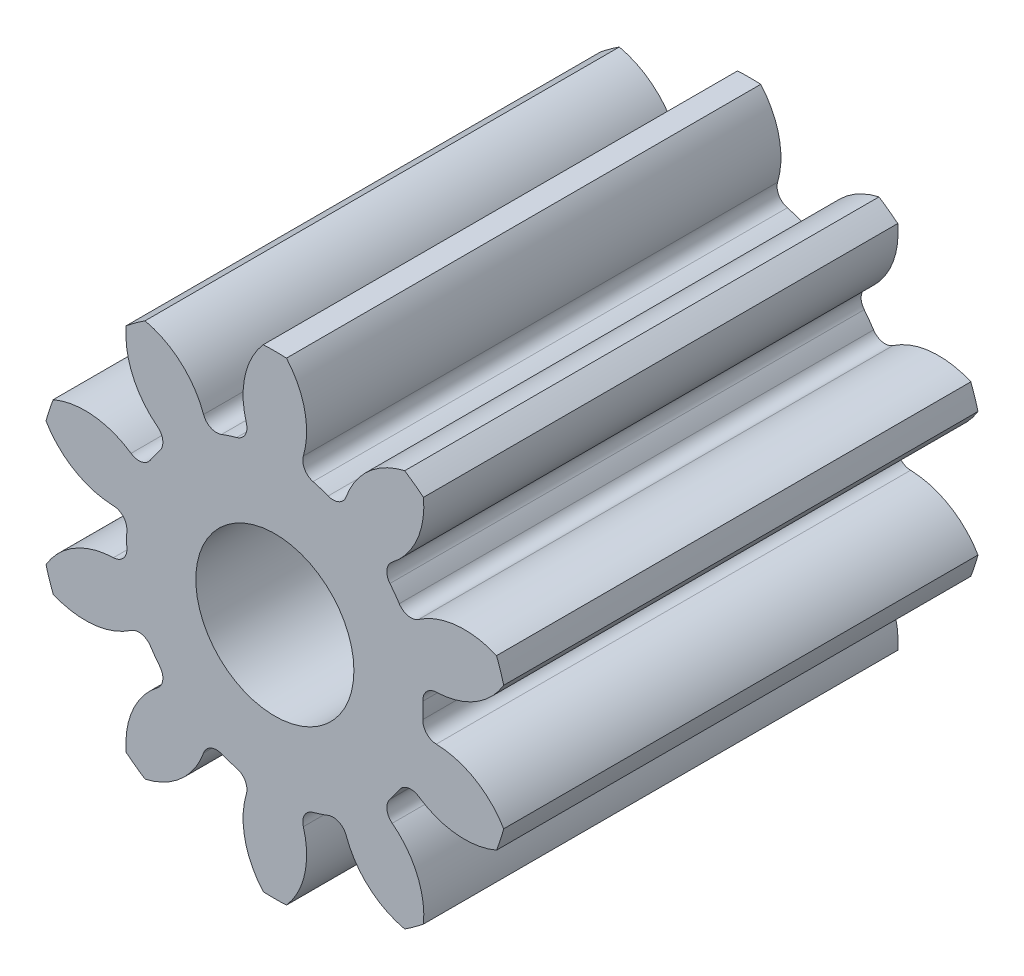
ISO-10303-21;
HEADER;
FILE_DESCRIPTION(('STEP AP214'),'2;1');
FILE_NAME('part.step','',(''),(''),'','','');
FILE_SCHEMA(('AUTOMOTIVE_DESIGN { 1 0 10303 214 1 1 1 1 }'));
ENDSEC;
DATA;
#1=APPLICATION_CONTEXT('core data for automotive mechanical design processes');
#2=APPLICATION_PROTOCOL_DEFINITION('international standard','automotive_design',2000,#1);
#3=PRODUCT_CONTEXT('',#1,'mechanical');
#4=PRODUCT('Part','Part','',(#3));
#5=PRODUCT_RELATED_PRODUCT_CATEGORY('part','',(#4));
#6=PRODUCT_DEFINITION_FORMATION('','',#4);
#7=PRODUCT_DEFINITION_CONTEXT('part definition',#1,'design');
#8=PRODUCT_DEFINITION('design','',#6,#7);
#9=PRODUCT_DEFINITION_SHAPE('','',#8);
#10=(LENGTH_UNIT() NAMED_UNIT(*) SI_UNIT(.MILLI.,.METRE.));
#11=(NAMED_UNIT(*) PLANE_ANGLE_UNIT() SI_UNIT($,.RADIAN.));
#12=(NAMED_UNIT(*) SI_UNIT($,.STERADIAN.) SOLID_ANGLE_UNIT());
#13=UNCERTAINTY_MEASURE_WITH_UNIT(LENGTH_MEASURE(1.E-05),#10,'distance_accuracy_value','');
#14=(GEOMETRIC_REPRESENTATION_CONTEXT(3) GLOBAL_UNCERTAINTY_ASSIGNED_CONTEXT((#13)) GLOBAL_UNIT_ASSIGNED_CONTEXT((#10,
#11,#12)) REPRESENTATION_CONTEXT('',''));
#15=CARTESIAN_POINT('',(0.,0.,0.));
#16=DIRECTION('',(0.,0.,1.));
#17=DIRECTION('',(1.,0.,0.));
#18=AXIS2_PLACEMENT_3D('',#15,#16,#17);
#19=CARTESIAN_POINT('',(-1.37870691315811,-0.560352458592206,6.));
#20=DIRECTION('',(0.,0.,1.));
#21=DIRECTION('',(1.,0.,0.));
#22=AXIS2_PLACEMENT_3D('',#19,#20,#21);
#23=PLANE('',#22);
#24=CARTESIAN_POINT('',(0.488647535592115,0.950220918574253,6.));
#25=DIRECTION('',(0.,0.,1.));
#26=DIRECTION('',(0.809016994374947,-0.587785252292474,0.));
#27=AXIS2_PLACEMENT_3D('',#24,#25,#26);
#28=CIRCLE('',#27,1.02488291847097);
#29=CARTESIAN_POINT('',(0.263714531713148,1.95011598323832,6.));
#30=VERTEX_POINT('',#29);
#31=CARTESIAN_POINT('',(-0.476887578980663,1.29391691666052,6.));
#32=VERTEX_POINT('',#31);
#33=EDGE_CURVE('E632',#30,#32,#28,.T.);
#34=ORIENTED_EDGE('',*,*,#33,.T.);
#35=CARTESIAN_POINT('',(-0.64175386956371,1.35260342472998,6.));
#36=DIRECTION('',(0.,0.,1.));
#37=DIRECTION('',(1.,0.,0.));
#38=AXIS2_PLACEMENT_3D('',#35,#36,#37);
#39=CIRCLE('',#38,0.175);
#40=CARTESIAN_POINT('',(-0.704664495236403,1.18930231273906,6.));
#41=VERTEX_POINT('',#40);
#42=EDGE_CURVE('E708',#32,#41,#39,.F.);
#43=ORIENTED_EDGE('',*,*,#42,.T.);
#44=CARTESIAN_POINT('',(-1.37870691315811,-0.560352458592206,6.));
#45=DIRECTION('',(0.,0.,1.));
#46=DIRECTION('',(1.,0.,0.));
#47=AXIS2_PLACEMENT_3D('',#44,#45,#46);
#48=CIRCLE('',#47,1.875);
#49=CARTESIAN_POINT('',(-0.895597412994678,1.25134017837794,6.));
#50=VERTEX_POINT('',#49);
#51=EDGE_CURVE('E652',#41,#50,#48,.T.);
#52=ORIENTED_EDGE('',*,*,#51,.T.);
#53=CARTESIAN_POINT('',(-0.850507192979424,1.42043149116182,6.));
#54=DIRECTION('',(0.,0.,1.));
#55=DIRECTION('',(1.,0.,0.));
#56=AXIS2_PLACEMENT_3D('',#53,#54,#55);
#57=CIRCLE('',#56,0.175);
#58=CARTESIAN_POINT('',(-1.01838188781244,1.46985908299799,6.));
#59=VERTEX_POINT('',#58);
#60=EDGE_CURVE('E683',#50,#59,#57,.F.);
#61=ORIENTED_EDGE('',*,*,#60,.T.);
#62=CARTESIAN_POINT('',(-2.00153564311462,1.75933048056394,6.));
#63=DIRECTION('',(0.,0.,-1.));
#64=DIRECTION('',(-1.,0.,0.));
#65=AXIS2_PLACEMENT_3D('',#62,#63,#64);
#66=CIRCLE('',#65,1.02488291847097);
#67=CARTESIAN_POINT('',(-1.23183744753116,2.43605027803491,6.));
#68=VERTEX_POINT('',#67);
#69=EDGE_CURVE('E654',#68,#59,#66,.T.);
#70=ORIENTED_EDGE('',*,*,#69,.F.);
#71=CARTESIAN_POINT('',(-1.37870691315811,-0.560352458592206,6.));
#72=DIRECTION('',(0.,0.,1.));
#73=DIRECTION('',(1.,0.,0.));
#74=AXIS2_PLACEMENT_3D('',#71,#72,#73);
#75=CIRCLE('',#74,3.);
#76=CARTESIAN_POINT('',(-1.52557637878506,2.43605027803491,6.));
#77=VERTEX_POINT('',#76);
#78=EDGE_CURVE('E657',#68,#77,#75,.T.);
#79=ORIENTED_EDGE('',*,*,#78,.T.);
#80=CARTESIAN_POINT('',(-0.755878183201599,1.75933048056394,6.));
#81=DIRECTION('',(0.,0.,1.));
#82=DIRECTION('',(1.,0.,0.));
#83=AXIS2_PLACEMENT_3D('',#80,#81,#82);
#84=CIRCLE('',#83,1.02488291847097);
#85=CARTESIAN_POINT('',(-1.73903193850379,1.46985908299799,6.));
#86=VERTEX_POINT('',#85);
#87=EDGE_CURVE('E659',#77,#86,#84,.T.);
#88=ORIENTED_EDGE('',*,*,#87,.T.);
#89=CARTESIAN_POINT('',(-1.9069066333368,1.42043149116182,6.));
#90=DIRECTION('',(0.,0.,1.));
#91=DIRECTION('',(1.,0.,0.));
#92=AXIS2_PLACEMENT_3D('',#89,#90,#91);
#93=CIRCLE('',#92,0.175);
#94=CARTESIAN_POINT('',(-1.86181641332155,1.25134017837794,6.));
#95=VERTEX_POINT('',#94);
#96=EDGE_CURVE('E687',#86,#95,#93,.F.);
#97=ORIENTED_EDGE('',*,*,#96,.T.);
#98=CARTESIAN_POINT('',(-1.37870691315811,-0.560352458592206,6.));
#99=DIRECTION('',(0.,0.,-1.));
#100=DIRECTION('',(-1.,0.,0.));
#101=AXIS2_PLACEMENT_3D('',#98,#99,#100);
#102=CIRCLE('',#101,1.875);
#103=CARTESIAN_POINT('',(-2.0527493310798,1.18930231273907,6.));
#104=VERTEX_POINT('',#103);
#105=EDGE_CURVE('E662',#104,#95,#102,.T.);
#106=ORIENTED_EDGE('',*,*,#105,.F.);
#107=CARTESIAN_POINT('',(-2.11565995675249,1.35260342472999,6.));
#108=DIRECTION('',(0.,0.,1.));
#109=DIRECTION('',(1.,0.,0.));
#110=AXIS2_PLACEMENT_3D('',#107,#108,#109);
#111=CIRCLE('',#110,0.175);
#112=CARTESIAN_POINT('',(-2.28052624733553,1.29391691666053,6.));
#113=VERTEX_POINT('',#112);
#114=EDGE_CURVE('E859',#104,#113,#111,.F.);
#115=ORIENTED_EDGE('',*,*,#114,.T.);
#116=CARTESIAN_POINT('',(-3.24606136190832,0.950220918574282,6.));
#117=DIRECTION('',(0.,0.,-1.));
#118=DIRECTION('',(-0.809016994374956,-0.587785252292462,0.));
#119=AXIS2_PLACEMENT_3D('',#116,#117,#118);
#120=CIRCLE('',#119,1.02488291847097);
#121=CARTESIAN_POINT('',(-3.02112835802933,1.95011598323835,6.));
#122=VERTEX_POINT('',#121);
#123=EDGE_CURVE('E435',#122,#113,#120,.T.);
#124=ORIENTED_EDGE('',*,*,#123,.F.);
#125=CARTESIAN_POINT('',(-1.37870691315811,-0.560352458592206,6.));
#126=DIRECTION('',(0.,0.,1.));
#127=DIRECTION('',(0.809016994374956,0.587785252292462,0.));
#128=AXIS2_PLACEMENT_3D('',#125,#126,#127);
#129=CIRCLE('',#128,3.);
#130=CARTESIAN_POINT('',(-3.25876814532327,1.77746057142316,6.));
#131=VERTEX_POINT('',#130);
#132=EDGE_CURVE('E408',#122,#131,#129,.T.);
#133=ORIENTED_EDGE('',*,*,#132,.T.);
#134=CARTESIAN_POINT('',(-2.23830330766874,1.68240000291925,6.));
#135=DIRECTION('',(0.,0.,1.));
#136=DIRECTION('',(0.809016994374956,0.587785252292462,0.));
#137=AXIS2_PLACEMENT_3D('',#134,#135,#136);
#138=CIRCLE('',#137,1.02488291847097);
#139=CARTESIAN_POINT('',(-2.86354438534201,0.87032944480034,6.));
#140=VERTEX_POINT('',#139);
#141=EDGE_CURVE('E438',#131,#140,#138,.T.);
#142=ORIENTED_EDGE('',*,*,#141,.T.);
#143=CARTESIAN_POINT('',(-2.9703050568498,0.73166741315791,6.));
#144=DIRECTION('',(0.,0.,1.));
#145=DIRECTION('',(1.,0.,0.));
#146=AXIS2_PLACEMENT_3D('',#143,#144,#145);
#147=CIRCLE('',#146,0.175);
#148=CARTESIAN_POINT('',(-2.83443692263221,0.621373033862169,6.));
#149=VERTEX_POINT('',#148);
#150=EDGE_CURVE('E11',#140,#149,#147,.F.);
#151=ORIENTED_EDGE('',*,*,#150,.T.);
#152=CARTESIAN_POINT('',(-1.37870691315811,-0.560352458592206,6.));
#153=DIRECTION('',(0.,0.,1.));
#154=DIRECTION('',(0.309016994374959,0.95105651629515,0.));
#155=AXIS2_PLACEMENT_3D('',#152,#153,#154);
#156=CIRCLE('',#155,1.875);
#157=CARTESIAN_POINT('',(-2.95243995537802,0.458955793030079,6.));
#158=VERTEX_POINT('',#157);
#159=EDGE_CURVE('E450',#149,#158,#156,.T.);
#160=ORIENTED_EDGE('',*,*,#159,.T.);
#161=CARTESIAN_POINT('',(-3.09932170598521,0.554091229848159,6.));
#162=DIRECTION('',(0.,0.,1.));
#163=DIRECTION('',(1.,0.,0.));
#164=AXIS2_PLACEMENT_3D('',#161,#162,#163);
#165=CIRCLE('',#164,0.175);
#166=CARTESIAN_POINT('',(-3.19820627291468,0.409706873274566,6.));
#167=VERTEX_POINT('',#166);
#168=EDGE_CURVE('E844',#158,#167,#165,.F.);
#169=ORIENTED_EDGE('',*,*,#168,.T.);
#170=CARTESIAN_POINT('',(-3.77732115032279,-0.435876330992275,6.));
#171=DIRECTION('',(0.,0.,-1.));
#172=DIRECTION('',(-0.309016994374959,-0.95105651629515,0.));
#173=AXIS2_PLACEMENT_3D('',#170,#171,#172);
#174=CIRCLE('',#173,1.02488291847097);
#175=CARTESIAN_POINT('',(-4.18307010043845,0.505268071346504,6.));
#176=VERTEX_POINT('',#175);
#177=EDGE_CURVE('E452',#176,#167,#174,.T.);
#178=ORIENTED_EDGE('',*,*,#177,.F.);
#179=CARTESIAN_POINT('',(-1.37870691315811,-0.560352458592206,6.));
#180=DIRECTION('',(0.,0.,1.));
#181=DIRECTION('',(0.309016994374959,0.95105651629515,0.));
#182=AXIS2_PLACEMENT_3D('',#179,#180,#181);
#183=CIRCLE('',#182,3.);
#184=CARTESIAN_POINT('',(-4.27384042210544,0.22590574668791,6.));
#185=VERTEX_POINT('',#184);
#186=EDGE_CURVE('E455',#176,#185,#183,.T.);
#187=ORIENTED_EDGE('',*,*,#186,.T.);
#188=CARTESIAN_POINT('',(-3.39239182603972,0.748814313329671,6.));
#189=DIRECTION('',(0.,0.,1.));
#190=DIRECTION('',(0.309016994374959,0.95105651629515,0.));
#191=AXIS2_PLACEMENT_3D('',#188,#189,#190);
#192=CIRCLE('',#191,1.02488291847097);
#193=CARTESIAN_POINT('',(-3.42089938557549,-0.275672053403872,6.));
#194=VERTEX_POINT('',#193);
#195=EDGE_CURVE('E457',#185,#194,#192,.T.);
#196=ORIENTED_EDGE('',*,*,#195,.T.);
#197=CARTESIAN_POINT('',(-3.42576708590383,-0.450604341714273,6.));
#198=DIRECTION('',(0.,0.,1.));
#199=DIRECTION('',(1.,0.,0.));
#200=AXIS2_PLACEMENT_3D('',#197,#198,#199);
#201=CIRCLE('',#200,0.175);
#202=CARTESIAN_POINT('',(-3.251018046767,-0.459973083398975,6.));
#203=VERTEX_POINT('',#202);
#204=EDGE_CURVE('E848',#194,#203,#201,.F.);
#205=ORIENTED_EDGE('',*,*,#204,.T.);
#206=CARTESIAN_POINT('',(-1.37870691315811,-0.560352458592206,6.));
#207=DIRECTION('',(0.,0.,1.));
#208=DIRECTION('',(-0.309016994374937,0.951056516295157,0.));
#209=AXIS2_PLACEMENT_3D('',#206,#207,#208);
#210=CIRCLE('',#209,1.875);
#211=CARTESIAN_POINT('',(-3.25101804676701,-0.660731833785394,6.));
#212=VERTEX_POINT('',#211);
#213=EDGE_CURVE('E475',#203,#212,#210,.T.);
#214=ORIENTED_EDGE('',*,*,#213,.T.);
#215=CARTESIAN_POINT('',(-3.42576708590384,-0.670100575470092,6.));
#216=DIRECTION('',(0.,0.,1.));
#217=DIRECTION('',(1.,0.,0.));
#218=AXIS2_PLACEMENT_3D('',#215,#216,#217);
#219=CIRCLE('',#218,0.175);
#220=CARTESIAN_POINT('',(-3.42089938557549,-0.845032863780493,6.));
#221=VERTEX_POINT('',#220);
#222=EDGE_CURVE('E824',#212,#221,#219,.F.);
#223=ORIENTED_EDGE('',*,*,#222,.T.);
#224=CARTESIAN_POINT('',(-3.39239182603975,-1.86951923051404,6.));
#225=DIRECTION('',(0.,0.,-1.));
#226=DIRECTION('',(0.309016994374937,-0.951056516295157,0.));
#227=AXIS2_PLACEMENT_3D('',#224,#225,#226);
#228=CIRCLE('',#227,1.02488291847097);
#229=CARTESIAN_POINT('',(-4.27384042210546,-1.34661066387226,6.));
#230=VERTEX_POINT('',#229);
#231=EDGE_CURVE('E477',#230,#221,#228,.T.);
#232=ORIENTED_EDGE('',*,*,#231,.F.);
#233=CARTESIAN_POINT('',(-1.37870691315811,-0.560352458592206,6.));
#234=DIRECTION('',(0.,0.,1.));
#235=DIRECTION('',(-0.309016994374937,0.951056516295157,0.));
#236=AXIS2_PLACEMENT_3D('',#233,#234,#235);
#237=CIRCLE('',#236,3.);
#238=CARTESIAN_POINT('',(-4.18307010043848,-1.62597298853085,6.));
#239=VERTEX_POINT('',#238);
#240=EDGE_CURVE('E480',#230,#239,#237,.T.);
#241=ORIENTED_EDGE('',*,*,#240,.T.);
#242=CARTESIAN_POINT('',(-3.77732115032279,-0.684828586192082,6.));
#243=DIRECTION('',(0.,0.,1.));
#244=DIRECTION('',(-0.309016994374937,0.951056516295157,0.));
#245=AXIS2_PLACEMENT_3D('',#242,#243,#244);
#246=CIRCLE('',#245,1.02488291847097);
#247=CARTESIAN_POINT('',(-3.19820627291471,-1.53041179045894,6.));
#248=VERTEX_POINT('',#247);
#249=EDGE_CURVE('E482',#239,#248,#246,.T.);
#250=ORIENTED_EDGE('',*,*,#249,.T.);
#251=CARTESIAN_POINT('',(-3.09932170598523,-1.67479614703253,6.));
#252=DIRECTION('',(0.,0.,1.));
#253=DIRECTION('',(1.,0.,0.));
#254=AXIS2_PLACEMENT_3D('',#251,#252,#253);
#255=CIRCLE('',#254,0.175);
#256=CARTESIAN_POINT('',(-2.95243995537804,-1.57966071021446,6.));
#257=VERTEX_POINT('',#256);
#258=EDGE_CURVE('E828',#248,#257,#255,.F.);
#259=ORIENTED_EDGE('',*,*,#258,.T.);
#260=CARTESIAN_POINT('',(-1.37870691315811,-0.560352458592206,6.));
#261=DIRECTION('',(0.,0.,1.));
#262=DIRECTION('',(-0.809016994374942,0.587785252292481,0.));
#263=AXIS2_PLACEMENT_3D('',#260,#261,#262);
#264=CIRCLE('',#263,1.875);
#265=CARTESIAN_POINT('',(-2.83443692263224,-1.74207795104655,6.));
#266=VERTEX_POINT('',#265);
#267=EDGE_CURVE('E500',#257,#266,#264,.T.);
#268=ORIENTED_EDGE('',*,*,#267,.T.);
#269=CARTESIAN_POINT('',(-2.97030505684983,-1.85237233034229,6.));
#270=DIRECTION('',(0.,0.,1.));
#271=DIRECTION('',(1.,0.,0.));
#272=AXIS2_PLACEMENT_3D('',#269,#270,#271);
#273=CIRCLE('',#272,0.175);
#274=CARTESIAN_POINT('',(-2.86354438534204,-1.99103436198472,6.));
#275=VERTEX_POINT('',#274);
#276=EDGE_CURVE('E804',#266,#275,#273,.F.);
#277=ORIENTED_EDGE('',*,*,#276,.T.);
#278=CARTESIAN_POINT('',(-2.23830330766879,-2.80310492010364,6.));
#279=DIRECTION('',(0.,0.,-1.));
#280=DIRECTION('',(0.809016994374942,-0.587785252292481,0.));
#281=AXIS2_PLACEMENT_3D('',#278,#279,#280);
#282=CIRCLE('',#281,1.02488291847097);
#283=CARTESIAN_POINT('',(-3.25876814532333,-2.89816548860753,6.));
#284=VERTEX_POINT('',#283);
#285=EDGE_CURVE('E502',#284,#275,#282,.T.);
#286=ORIENTED_EDGE('',*,*,#285,.F.);
#287=CARTESIAN_POINT('',(-1.37870691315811,-0.560352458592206,6.));
#288=DIRECTION('',(0.,0.,1.));
#289=DIRECTION('',(-0.809016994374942,0.587785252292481,0.));
#290=AXIS2_PLACEMENT_3D('',#287,#288,#289);
#291=CIRCLE('',#290,3.);
#292=CARTESIAN_POINT('',(-3.02112835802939,-3.07082090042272,6.));
#293=VERTEX_POINT('',#292);
#294=EDGE_CURVE('E505',#284,#293,#291,.T.);
#295=ORIENTED_EDGE('',*,*,#294,.T.);
#296=CARTESIAN_POINT('',(-3.24606136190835,-2.07092583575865,6.));
#297=DIRECTION('',(0.,0.,1.));
#298=DIRECTION('',(-0.809016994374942,0.587785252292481,0.));
#299=AXIS2_PLACEMENT_3D('',#296,#297,#298);
#300=CIRCLE('',#299,1.02488291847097);
#301=CARTESIAN_POINT('',(-2.28052624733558,-2.41462183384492,6.));
#302=VERTEX_POINT('',#301);
#303=EDGE_CURVE('E507',#293,#302,#300,.T.);
#304=ORIENTED_EDGE('',*,*,#303,.T.);
#305=CARTESIAN_POINT('',(-2.11565995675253,-2.47330834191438,6.));
#306=DIRECTION('',(0.,0.,1.));
#307=DIRECTION('',(1.,0.,0.));
#308=AXIS2_PLACEMENT_3D('',#305,#306,#307);
#309=CIRCLE('',#308,0.175);
#310=CARTESIAN_POINT('',(-2.05274933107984,-2.31000722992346,6.));
#311=VERTEX_POINT('',#310);
#312=EDGE_CURVE('E808',#302,#311,#309,.F.);
#313=ORIENTED_EDGE('',*,*,#312,.T.);
#314=CARTESIAN_POINT('',(-1.37870691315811,-0.560352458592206,6.));
#315=DIRECTION('',(0.,0.,1.));
#316=DIRECTION('',(-1.,0.,0.));
#317=AXIS2_PLACEMENT_3D('',#314,#315,#316);
#318=CIRCLE('',#317,1.875);
#319=CARTESIAN_POINT('',(-1.86181641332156,-2.37204509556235,6.));
#320=VERTEX_POINT('',#319);
#321=EDGE_CURVE('E525',#311,#320,#318,.T.);
#322=ORIENTED_EDGE('',*,*,#321,.T.);
#323=CARTESIAN_POINT('',(-1.90690663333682,-2.54113640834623,6.));
#324=DIRECTION('',(0.,0.,1.));
#325=DIRECTION('',(1.,0.,0.));
#326=AXIS2_PLACEMENT_3D('',#323,#324,#325);
#327=CIRCLE('',#326,0.175);
#328=CARTESIAN_POINT('',(-1.7390319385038,-2.59056400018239,6.));
#329=VERTEX_POINT('',#328);
#330=EDGE_CURVE('E784',#320,#329,#327,.F.);
#331=ORIENTED_EDGE('',*,*,#330,.T.);
#332=CARTESIAN_POINT('',(-0.755878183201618,-2.88003539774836,6.));
#333=DIRECTION('',(0.,0.,-1.));
#334=DIRECTION('',(1.,0.,0.));
#335=AXIS2_PLACEMENT_3D('',#332,#333,#334);
#336=CIRCLE('',#335,1.02488291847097);
#337=CARTESIAN_POINT('',(-1.52557637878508,-3.55675519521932,6.));
#338=VERTEX_POINT('',#337);
#339=EDGE_CURVE('E527',#338,#329,#336,.T.);
#340=ORIENTED_EDGE('',*,*,#339,.F.);
#341=CARTESIAN_POINT('',(-1.37870691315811,-0.560352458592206,6.));
#342=DIRECTION('',(0.,0.,1.));
#343=DIRECTION('',(-1.,0.,0.));
#344=AXIS2_PLACEMENT_3D('',#341,#342,#343);
#345=CIRCLE('',#344,3.);
#346=CARTESIAN_POINT('',(-1.23183744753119,-3.55675519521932,6.));
#347=VERTEX_POINT('',#346);
#348=EDGE_CURVE('E530',#338,#347,#345,.T.);
#349=ORIENTED_EDGE('',*,*,#348,.T.);
#350=CARTESIAN_POINT('',(-2.00153564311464,-2.88003539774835,6.));
#351=DIRECTION('',(0.,0.,1.));
#352=DIRECTION('',(-1.,0.,0.));
#353=AXIS2_PLACEMENT_3D('',#350,#351,#352);
#354=CIRCLE('',#353,1.02488291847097);
#355=CARTESIAN_POINT('',(-1.01838188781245,-2.5905640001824,6.));
#356=VERTEX_POINT('',#355);
#357=EDGE_CURVE('E532',#347,#356,#354,.T.);
#358=ORIENTED_EDGE('',*,*,#357,.T.);
#359=CARTESIAN_POINT('',(-0.850507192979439,-2.54113640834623,6.));
#360=DIRECTION('',(0.,0.,1.));
#361=DIRECTION('',(1.,0.,0.));
#362=AXIS2_PLACEMENT_3D('',#359,#360,#361);
#363=CIRCLE('',#362,0.175);
#364=CARTESIAN_POINT('',(-0.895597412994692,-2.37204509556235,6.));
#365=VERTEX_POINT('',#364);
#366=EDGE_CURVE('E788',#356,#365,#363,.F.);
#367=ORIENTED_EDGE('',*,*,#366,.T.);
#368=CARTESIAN_POINT('',(-1.37870691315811,-0.560352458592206,6.));
#369=DIRECTION('',(0.,0.,1.));
#370=DIRECTION('',(-0.809016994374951,-0.587785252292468,0.));
#371=AXIS2_PLACEMENT_3D('',#368,#369,#370);
#372=CIRCLE('',#371,1.875);
#373=CARTESIAN_POINT('',(-0.704664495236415,-2.31000722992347,6.));
#374=VERTEX_POINT('',#373);
#375=EDGE_CURVE('E550',#365,#374,#372,.T.);
#376=ORIENTED_EDGE('',*,*,#375,.T.);
#377=CARTESIAN_POINT('',(-0.641753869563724,-2.47330834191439,6.));
#378=DIRECTION('',(0.,0.,1.));
#379=DIRECTION('',(1.,0.,0.));
#380=AXIS2_PLACEMENT_3D('',#377,#378,#379);
#381=CIRCLE('',#380,0.175);
#382=CARTESIAN_POINT('',(-0.476887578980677,-2.41462183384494,6.));
#383=VERTEX_POINT('',#382);
#384=EDGE_CURVE('E764',#374,#383,#381,.F.);
#385=ORIENTED_EDGE('',*,*,#384,.T.);
#386=CARTESIAN_POINT('',(0.488647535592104,-2.07092583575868,6.));
#387=DIRECTION('',(0.,0.,-1.));
#388=DIRECTION('',(0.809016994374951,0.587785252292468,0.));
#389=AXIS2_PLACEMENT_3D('',#386,#387,#388);
#390=CIRCLE('',#389,1.02488291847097);
#391=CARTESIAN_POINT('',(0.263714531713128,-3.07082090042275,6.));
#392=VERTEX_POINT('',#391);
#393=EDGE_CURVE('E552',#392,#383,#390,.T.);
#394=ORIENTED_EDGE('',*,*,#393,.F.);
#395=CARTESIAN_POINT('',(-1.37870691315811,-0.560352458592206,6.));
#396=DIRECTION('',(0.,0.,1.));
#397=DIRECTION('',(-0.809016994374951,-0.587785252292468,0.));
#398=AXIS2_PLACEMENT_3D('',#395,#396,#397);
#399=CIRCLE('',#398,3.);
#400=CARTESIAN_POINT('',(0.501354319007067,-2.89816548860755,6.));
#401=VERTEX_POINT('',#400);
#402=EDGE_CURVE('E555',#392,#401,#399,.T.);
#403=ORIENTED_EDGE('',*,*,#402,.T.);
#404=CARTESIAN_POINT('',(-0.519110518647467,-2.80310492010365,6.));
#405=DIRECTION('',(0.,0.,1.));
#406=DIRECTION('',(-0.809016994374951,-0.587785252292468,0.));
#407=AXIS2_PLACEMENT_3D('',#404,#405,#406);
#408=CIRCLE('',#407,1.02488291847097);
#409=CARTESIAN_POINT('',(0.106130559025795,-1.99103436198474,6.));
#410=VERTEX_POINT('',#409);
#411=EDGE_CURVE('E557',#401,#410,#408,.T.);
#412=ORIENTED_EDGE('',*,*,#411,.T.);
#413=CARTESIAN_POINT('',(0.212891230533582,-1.85237233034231,6.));
#414=DIRECTION('',(0.,0.,1.));
#415=DIRECTION('',(1.,0.,0.));
#416=AXIS2_PLACEMENT_3D('',#413,#414,#415);
#417=CIRCLE('',#416,0.175);
#418=CARTESIAN_POINT('',(0.077023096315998,-1.74207795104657,6.));
#419=VERTEX_POINT('',#418);
#420=EDGE_CURVE('E768',#410,#419,#417,.F.);
#421=ORIENTED_EDGE('',*,*,#420,.T.);
#422=CARTESIAN_POINT('',(-1.37870691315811,-0.560352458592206,6.));
#423=DIRECTION('',(0.,0.,1.));
#424=DIRECTION('',(-0.309016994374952,-0.951056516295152,0.));
#425=AXIS2_PLACEMENT_3D('',#422,#423,#424);
#426=CIRCLE('',#425,1.875);
#427=CARTESIAN_POINT('',(0.195026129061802,-1.57966071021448,6.));
#428=VERTEX_POINT('',#427);
#429=EDGE_CURVE('E575',#419,#428,#426,.T.);
#430=ORIENTED_EDGE('',*,*,#429,.T.);
#431=CARTESIAN_POINT('',(0.341907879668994,-1.67479614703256,6.));
#432=DIRECTION('',(0.,0.,1.));
#433=DIRECTION('',(1.,0.,0.));
#434=AXIS2_PLACEMENT_3D('',#431,#432,#433);
#435=CIRCLE('',#434,0.175);
#436=CARTESIAN_POINT('',(0.440792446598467,-1.53041179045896,6.));
#437=VERTEX_POINT('',#436);
#438=EDGE_CURVE('E744',#428,#437,#435,.F.);
#439=ORIENTED_EDGE('',*,*,#438,.T.);
#440=CARTESIAN_POINT('',(1.01990732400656,-0.684828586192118,6.));
#441=DIRECTION('',(0.,0.,-1.));
#442=DIRECTION('',(0.309016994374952,0.951056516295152,0.));
#443=AXIS2_PLACEMENT_3D('',#440,#441,#442);
#444=CIRCLE('',#443,1.02488291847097);
#445=CARTESIAN_POINT('',(1.42565627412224,-1.62597298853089,6.));
#446=VERTEX_POINT('',#445);
#447=EDGE_CURVE('E577',#446,#437,#444,.T.);
#448=ORIENTED_EDGE('',*,*,#447,.F.);
#449=CARTESIAN_POINT('',(-1.37870691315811,-0.560352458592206,6.));
#450=DIRECTION('',(0.,0.,1.));
#451=DIRECTION('',(-0.309016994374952,-0.951056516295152,0.));
#452=AXIS2_PLACEMENT_3D('',#449,#450,#451);
#453=CIRCLE('',#452,3.);
#454=CARTESIAN_POINT('',(1.51642659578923,-1.3466106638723,6.));
#455=VERTEX_POINT('',#454);
#456=EDGE_CURVE('E580',#446,#455,#453,.T.);
#457=ORIENTED_EDGE('',*,*,#456,.T.);
#458=CARTESIAN_POINT('',(0.634977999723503,-1.86951923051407,6.));
#459=DIRECTION('',(0.,0.,1.));
#460=DIRECTION('',(-0.309016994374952,-0.951056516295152,0.));
#461=AXIS2_PLACEMENT_3D('',#458,#459,#460);
#462=CIRCLE('',#461,1.02488291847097);
#463=CARTESIAN_POINT('',(0.663485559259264,-0.845032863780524,6.));
#464=VERTEX_POINT('',#463);
#465=EDGE_CURVE('E582',#455,#464,#462,.T.);
#466=ORIENTED_EDGE('',*,*,#465,.T.);
#467=CARTESIAN_POINT('',(0.668353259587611,-0.670100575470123,6.));
#468=DIRECTION('',(0.,0.,1.));
#469=DIRECTION('',(1.,0.,0.));
#470=AXIS2_PLACEMENT_3D('',#467,#468,#469);
#471=CIRCLE('',#470,0.175);
#472=CARTESIAN_POINT('',(0.493604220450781,-0.660731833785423,6.));
#473=VERTEX_POINT('',#472);
#474=EDGE_CURVE('E748',#464,#473,#471,.F.);
#475=ORIENTED_EDGE('',*,*,#474,.T.);
#476=CARTESIAN_POINT('',(-1.37870691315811,-0.560352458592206,6.));
#477=DIRECTION('',(0.,0.,1.));
#478=DIRECTION('',(0.309016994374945,-0.951056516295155,0.));
#479=AXIS2_PLACEMENT_3D('',#476,#477,#478);
#480=CIRCLE('',#479,1.875);
#481=CARTESIAN_POINT('',(0.493604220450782,-0.459973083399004,6.));
#482=VERTEX_POINT('',#481);
#483=EDGE_CURVE('E600',#473,#482,#480,.T.);
#484=ORIENTED_EDGE('',*,*,#483,.T.);
#485=CARTESIAN_POINT('',(0.668353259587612,-0.450604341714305,6.));
#486=DIRECTION('',(0.,0.,1.));
#487=DIRECTION('',(1.,0.,0.));
#488=AXIS2_PLACEMENT_3D('',#485,#486,#487);
#489=CIRCLE('',#488,0.175);
#490=CARTESIAN_POINT('',(0.663485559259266,-0.275672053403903,6.));
#491=VERTEX_POINT('',#490);
#492=EDGE_CURVE('E724',#482,#491,#489,.F.);
#493=ORIENTED_EDGE('',*,*,#492,.T.);
#494=CARTESIAN_POINT('',(0.634977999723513,0.74881431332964,6.));
#495=DIRECTION('',(0.,0.,-1.));
#496=DIRECTION('',(-0.309016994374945,0.951056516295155,0.));
#497=AXIS2_PLACEMENT_3D('',#494,#495,#496);
#498=CIRCLE('',#497,1.02488291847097);
#499=CARTESIAN_POINT('',(1.51642659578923,0.225905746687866,6.));
#500=VERTEX_POINT('',#499);
#501=EDGE_CURVE('E602',#500,#491,#498,.T.);
#502=ORIENTED_EDGE('',*,*,#501,.F.);
#503=CARTESIAN_POINT('',(-1.37870691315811,-0.560352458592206,6.));
#504=DIRECTION('',(0.,0.,1.));
#505=DIRECTION('',(0.309016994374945,-0.951056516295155,0.));
#506=AXIS2_PLACEMENT_3D('',#503,#504,#505);
#507=CIRCLE('',#506,3.);
#508=CARTESIAN_POINT('',(1.42565627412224,0.50526807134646,6.));
#509=VERTEX_POINT('',#508);
#510=EDGE_CURVE('E605',#500,#509,#507,.T.);
#511=ORIENTED_EDGE('',*,*,#510,.T.);
#512=CARTESIAN_POINT('',(1.01990732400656,-0.435876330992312,6.));
#513=DIRECTION('',(0.,0.,1.));
#514=DIRECTION('',(0.309016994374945,-0.951056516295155,0.));
#515=AXIS2_PLACEMENT_3D('',#512,#513,#514);
#516=CIRCLE('',#515,1.02488291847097);
#517=CARTESIAN_POINT('',(0.440792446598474,0.409706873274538,6.));
#518=VERTEX_POINT('',#517);
#519=EDGE_CURVE('E607',#509,#518,#516,.T.);
#520=ORIENTED_EDGE('',*,*,#519,.T.);
#521=CARTESIAN_POINT('',(0.341907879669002,0.554091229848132,6.));
#522=DIRECTION('',(0.,0.,1.));
#523=DIRECTION('',(1.,0.,0.));
#524=AXIS2_PLACEMENT_3D('',#521,#522,#523);
#525=CIRCLE('',#524,0.175);
#526=CARTESIAN_POINT('',(0.19502612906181,0.458955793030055,6.));
#527=VERTEX_POINT('',#526);
#528=EDGE_CURVE('E728',#518,#527,#525,.F.);
#529=ORIENTED_EDGE('',*,*,#528,.T.);
#530=CARTESIAN_POINT('',(-1.37870691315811,-0.560352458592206,6.));
#531=DIRECTION('',(0.,0.,1.));
#532=DIRECTION('',(0.809016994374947,-0.587785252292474,0.));
#533=AXIS2_PLACEMENT_3D('',#530,#531,#532);
#534=CIRCLE('',#533,1.875);
#535=CARTESIAN_POINT('',(0.0770230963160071,0.621373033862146,6.));
#536=VERTEX_POINT('',#535);
#537=EDGE_CURVE('E625',#527,#536,#534,.T.);
#538=ORIENTED_EDGE('',*,*,#537,.T.);
#539=CARTESIAN_POINT('',(0.212891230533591,0.731667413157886,6.));
#540=DIRECTION('',(0.,0.,1.));
#541=DIRECTION('',(1.,0.,0.));
#542=AXIS2_PLACEMENT_3D('',#539,#540,#541);
#543=CIRCLE('',#542,0.175);
#544=CARTESIAN_POINT('',(0.106130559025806,0.870329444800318,6.));
#545=VERTEX_POINT('',#544);
#546=EDGE_CURVE('E704',#536,#545,#543,.F.);
#547=ORIENTED_EDGE('',*,*,#546,.T.);
#548=CARTESIAN_POINT('',(-0.51911051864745,1.68240000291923,6.));
#549=DIRECTION('',(0.,0.,-1.));
#550=DIRECTION('',(-0.809016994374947,0.587785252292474,0.));
#551=AXIS2_PLACEMENT_3D('',#548,#549,#550);
#552=CIRCLE('',#551,1.02488291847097);
#553=CARTESIAN_POINT('',(0.501354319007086,1.77746057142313,6.));
#554=VERTEX_POINT('',#553);
#555=EDGE_CURVE('E627',#554,#545,#552,.T.);
#556=ORIENTED_EDGE('',*,*,#555,.F.);
#557=CARTESIAN_POINT('',(-1.37870691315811,-0.560352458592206,6.));
#558=DIRECTION('',(0.,0.,1.));
#559=DIRECTION('',(0.809016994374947,-0.587785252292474,0.));
#560=AXIS2_PLACEMENT_3D('',#557,#558,#559);
#561=CIRCLE('',#560,3.);
#562=EDGE_CURVE('E630',#554,#30,#561,.T.);
#563=ORIENTED_EDGE('',*,*,#562,.T.);
#564=EDGE_LOOP('',(#34,#43,#52,#61,#70,#79,#88,#97,#106,#115,#124,#133,#142,#151,#160,#169,#178,
#187,#196,#205,#214,#223,#232,#241,#250,#259,#268,#277,#286,#295,#304,#313,#322,#331,#340,#349,
#358,#367,#376,#385,#394,#403,#412,#421,#430,#439,#448,#457,#466,#475,#484,#493,#502,#511,#520,
#529,#538,#547,#556,#563));
#565=FACE_BOUND('',#564,.T.);
#566=CARTESIAN_POINT('',(-1.37870691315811,-0.560352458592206,6.));
#567=DIRECTION('',(0.,0.,1.));
#568=DIRECTION('',(1.,0.,0.));
#569=AXIS2_PLACEMENT_3D('',#566,#567,#568);
#570=CIRCLE('',#569,1.);
#571=CARTESIAN_POINT('',(-0.378706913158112,-0.560352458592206,6.));
#572=VERTEX_POINT('',#571);
#573=EDGE_CURVE('E427',#572,#572,#570,.T.);
#574=ORIENTED_EDGE('',*,*,#573,.F.);
#575=EDGE_LOOP('',(#574));
#576=FACE_BOUND('',#575,.T.);
#577=ADVANCED_FACE('F26',(#565,#576),#23,.T.);
#578=CARTESIAN_POINT('',(-1.37870691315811,-0.560352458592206,0.));
#579=DIRECTION('',(0.,0.,1.));
#580=DIRECTION('',(1.,0.,0.));
#581=AXIS2_PLACEMENT_3D('',#578,#579,#580);
#582=PLANE('',#581);
#583=CARTESIAN_POINT('',(-1.37870691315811,-0.560352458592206,0.));
#584=DIRECTION('',(0.,0.,1.));
#585=DIRECTION('',(1.,0.,0.));
#586=AXIS2_PLACEMENT_3D('',#583,#584,#585);
#587=CIRCLE('',#586,1.875);
#588=CARTESIAN_POINT('',(-0.704664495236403,1.18930231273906,0.));
#589=VERTEX_POINT('',#588);
#590=CARTESIAN_POINT('',(-0.895597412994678,1.25134017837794,0.));
#591=VERTEX_POINT('',#590);
#592=EDGE_CURVE('E640',#589,#591,#587,.T.);
#593=ORIENTED_EDGE('',*,*,#592,.F.);
#594=CARTESIAN_POINT('',(-0.64175386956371,1.35260342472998,0.));
#595=DIRECTION('',(0.,0.,1.));
#596=DIRECTION('',(1.,0.,0.));
#597=AXIS2_PLACEMENT_3D('',#594,#595,#596);
#598=CIRCLE('',#597,0.175);
#599=CARTESIAN_POINT('',(-0.476887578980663,1.29391691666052,0.));
#600=VERTEX_POINT('',#599);
#601=EDGE_CURVE('E706',#589,#600,#598,.T.);
#602=ORIENTED_EDGE('',*,*,#601,.T.);
#603=CARTESIAN_POINT('',(0.488647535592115,0.950220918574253,0.));
#604=DIRECTION('',(0.,0.,1.));
#605=DIRECTION('',(0.809016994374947,-0.587785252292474,0.));
#606=AXIS2_PLACEMENT_3D('',#603,#604,#605);
#607=CIRCLE('',#606,1.02488291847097);
#608=CARTESIAN_POINT('',(0.263714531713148,1.95011598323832,0.));
#609=VERTEX_POINT('',#608);
#610=EDGE_CURVE('E622',#609,#600,#607,.T.);
#611=ORIENTED_EDGE('',*,*,#610,.F.);
#612=CARTESIAN_POINT('',(-1.37870691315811,-0.560352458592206,0.));
#613=DIRECTION('',(0.,0.,1.));
#614=DIRECTION('',(0.809016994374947,-0.587785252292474,0.));
#615=AXIS2_PLACEMENT_3D('',#612,#613,#614);
#616=CIRCLE('',#615,3.);
#617=CARTESIAN_POINT('',(0.501354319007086,1.77746057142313,0.));
#618=VERTEX_POINT('',#617);
#619=EDGE_CURVE('E620',#618,#609,#616,.T.);
#620=ORIENTED_EDGE('',*,*,#619,.F.);
#621=CARTESIAN_POINT('',(-0.51911051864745,1.68240000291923,0.));
#622=DIRECTION('',(0.,0.,-1.));
#623=DIRECTION('',(-0.809016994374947,0.587785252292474,0.));
#624=AXIS2_PLACEMENT_3D('',#621,#622,#623);
#625=CIRCLE('',#624,1.02488291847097);
#626=CARTESIAN_POINT('',(0.106130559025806,0.870329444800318,0.));
#627=VERTEX_POINT('',#626);
#628=EDGE_CURVE('E617',#618,#627,#625,.T.);
#629=ORIENTED_EDGE('',*,*,#628,.T.);
#630=CARTESIAN_POINT('',(0.212891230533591,0.731667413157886,0.));
#631=DIRECTION('',(0.,0.,1.));
#632=DIRECTION('',(1.,0.,0.));
#633=AXIS2_PLACEMENT_3D('',#630,#631,#632);
#634=CIRCLE('',#633,0.175);
#635=CARTESIAN_POINT('',(0.0770230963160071,0.621373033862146,0.));
#636=VERTEX_POINT('',#635);
#637=EDGE_CURVE('E701',#627,#636,#634,.T.);
#638=ORIENTED_EDGE('',*,*,#637,.T.);
#639=CARTESIAN_POINT('',(-1.37870691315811,-0.560352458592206,0.));
#640=DIRECTION('',(0.,0.,1.));
#641=DIRECTION('',(0.809016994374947,-0.587785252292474,0.));
#642=AXIS2_PLACEMENT_3D('',#639,#640,#641);
#643=CIRCLE('',#642,1.875);
#644=CARTESIAN_POINT('',(0.19502612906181,0.458955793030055,0.));
#645=VERTEX_POINT('',#644);
#646=EDGE_CURVE('E615',#645,#636,#643,.T.);
#647=ORIENTED_EDGE('',*,*,#646,.F.);
#648=CARTESIAN_POINT('',(0.341907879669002,0.554091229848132,0.));
#649=DIRECTION('',(0.,0.,1.));
#650=DIRECTION('',(1.,0.,0.));
#651=AXIS2_PLACEMENT_3D('',#648,#649,#650);
#652=CIRCLE('',#651,0.175);
#653=CARTESIAN_POINT('',(0.440792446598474,0.409706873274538,0.));
#654=VERTEX_POINT('',#653);
#655=EDGE_CURVE('E726',#645,#654,#652,.T.);
#656=ORIENTED_EDGE('',*,*,#655,.T.);
#657=CARTESIAN_POINT('',(1.01990732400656,-0.435876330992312,0.));
#658=DIRECTION('',(0.,0.,1.));
#659=DIRECTION('',(0.309016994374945,-0.951056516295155,0.));
#660=AXIS2_PLACEMENT_3D('',#657,#658,#659);
#661=CIRCLE('',#660,1.02488291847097);
#662=CARTESIAN_POINT('',(1.42565627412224,0.50526807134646,0.));
#663=VERTEX_POINT('',#662);
#664=EDGE_CURVE('E597',#663,#654,#661,.T.);
#665=ORIENTED_EDGE('',*,*,#664,.F.);
#666=CARTESIAN_POINT('',(-1.37870691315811,-0.560352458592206,0.));
#667=DIRECTION('',(0.,0.,1.));
#668=DIRECTION('',(0.309016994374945,-0.951056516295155,0.));
#669=AXIS2_PLACEMENT_3D('',#666,#667,#668);
#670=CIRCLE('',#669,3.);
#671=CARTESIAN_POINT('',(1.51642659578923,0.225905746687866,0.));
#672=VERTEX_POINT('',#671);
#673=EDGE_CURVE('E595',#672,#663,#670,.T.);
#674=ORIENTED_EDGE('',*,*,#673,.F.);
#675=CARTESIAN_POINT('',(0.634977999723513,0.74881431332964,0.));
#676=DIRECTION('',(0.,0.,-1.));
#677=DIRECTION('',(-0.309016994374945,0.951056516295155,0.));
#678=AXIS2_PLACEMENT_3D('',#675,#676,#677);
#679=CIRCLE('',#678,1.02488291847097);
#680=CARTESIAN_POINT('',(0.663485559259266,-0.275672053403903,0.));
#681=VERTEX_POINT('',#680);
#682=EDGE_CURVE('E592',#672,#681,#679,.T.);
#683=ORIENTED_EDGE('',*,*,#682,.T.);
#684=CARTESIAN_POINT('',(0.668353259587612,-0.450604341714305,0.));
#685=DIRECTION('',(0.,0.,1.));
#686=DIRECTION('',(1.,0.,0.));
#687=AXIS2_PLACEMENT_3D('',#684,#685,#686);
#688=CIRCLE('',#687,0.175);
#689=CARTESIAN_POINT('',(0.493604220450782,-0.459973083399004,0.));
#690=VERTEX_POINT('',#689);
#691=EDGE_CURVE('E721',#681,#690,#688,.T.);
#692=ORIENTED_EDGE('',*,*,#691,.T.);
#693=CARTESIAN_POINT('',(-1.37870691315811,-0.560352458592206,0.));
#694=DIRECTION('',(0.,0.,1.));
#695=DIRECTION('',(0.309016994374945,-0.951056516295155,0.));
#696=AXIS2_PLACEMENT_3D('',#693,#694,#695);
#697=CIRCLE('',#696,1.875);
#698=CARTESIAN_POINT('',(0.493604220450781,-0.660731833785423,0.));
#699=VERTEX_POINT('',#698);
#700=EDGE_CURVE('E590',#699,#690,#697,.T.);
#701=ORIENTED_EDGE('',*,*,#700,.F.);
#702=CARTESIAN_POINT('',(0.668353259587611,-0.670100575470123,0.));
#703=DIRECTION('',(0.,0.,1.));
#704=DIRECTION('',(1.,0.,0.));
#705=AXIS2_PLACEMENT_3D('',#702,#703,#704);
#706=CIRCLE('',#705,0.175);
#707=CARTESIAN_POINT('',(0.663485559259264,-0.845032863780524,0.));
#708=VERTEX_POINT('',#707);
#709=EDGE_CURVE('E746',#699,#708,#706,.T.);
#710=ORIENTED_EDGE('',*,*,#709,.T.);
#711=CARTESIAN_POINT('',(0.634977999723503,-1.86951923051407,0.));
#712=DIRECTION('',(0.,0.,1.));
#713=DIRECTION('',(-0.309016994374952,-0.951056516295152,0.));
#714=AXIS2_PLACEMENT_3D('',#711,#712,#713);
#715=CIRCLE('',#714,1.02488291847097);
#716=CARTESIAN_POINT('',(1.51642659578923,-1.3466106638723,0.));
#717=VERTEX_POINT('',#716);
#718=EDGE_CURVE('E572',#717,#708,#715,.T.);
#719=ORIENTED_EDGE('',*,*,#718,.F.);
#720=CARTESIAN_POINT('',(-1.37870691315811,-0.560352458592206,0.));
#721=DIRECTION('',(0.,0.,1.));
#722=DIRECTION('',(-0.309016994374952,-0.951056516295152,0.));
#723=AXIS2_PLACEMENT_3D('',#720,#721,#722);
#724=CIRCLE('',#723,3.);
#725=CARTESIAN_POINT('',(1.42565627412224,-1.62597298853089,0.));
#726=VERTEX_POINT('',#725);
#727=EDGE_CURVE('E570',#726,#717,#724,.T.);
#728=ORIENTED_EDGE('',*,*,#727,.F.);
#729=CARTESIAN_POINT('',(1.01990732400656,-0.684828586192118,0.));
#730=DIRECTION('',(0.,0.,-1.));
#731=DIRECTION('',(0.309016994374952,0.951056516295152,0.));
#732=AXIS2_PLACEMENT_3D('',#729,#730,#731);
#733=CIRCLE('',#732,1.02488291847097);
#734=CARTESIAN_POINT('',(0.440792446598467,-1.53041179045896,0.));
#735=VERTEX_POINT('',#734);
#736=EDGE_CURVE('E567',#726,#735,#733,.T.);
#737=ORIENTED_EDGE('',*,*,#736,.T.);
#738=CARTESIAN_POINT('',(0.341907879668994,-1.67479614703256,0.));
#739=DIRECTION('',(0.,0.,1.));
#740=DIRECTION('',(1.,0.,0.));
#741=AXIS2_PLACEMENT_3D('',#738,#739,#740);
#742=CIRCLE('',#741,0.175);
#743=CARTESIAN_POINT('',(0.195026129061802,-1.57966071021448,0.));
#744=VERTEX_POINT('',#743);
#745=EDGE_CURVE('E741',#735,#744,#742,.T.);
#746=ORIENTED_EDGE('',*,*,#745,.T.);
#747=CARTESIAN_POINT('',(-1.37870691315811,-0.560352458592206,0.));
#748=DIRECTION('',(0.,0.,1.));
#749=DIRECTION('',(-0.309016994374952,-0.951056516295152,0.));
#750=AXIS2_PLACEMENT_3D('',#747,#748,#749);
#751=CIRCLE('',#750,1.875);
#752=CARTESIAN_POINT('',(0.077023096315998,-1.74207795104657,0.));
#753=VERTEX_POINT('',#752);
#754=EDGE_CURVE('E565',#753,#744,#751,.T.);
#755=ORIENTED_EDGE('',*,*,#754,.F.);
#756=CARTESIAN_POINT('',(0.212891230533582,-1.85237233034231,0.));
#757=DIRECTION('',(0.,0.,1.));
#758=DIRECTION('',(1.,0.,0.));
#759=AXIS2_PLACEMENT_3D('',#756,#757,#758);
#760=CIRCLE('',#759,0.175);
#761=CARTESIAN_POINT('',(0.106130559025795,-1.99103436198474,0.));
#762=VERTEX_POINT('',#761);
#763=EDGE_CURVE('E766',#753,#762,#760,.T.);
#764=ORIENTED_EDGE('',*,*,#763,.T.);
#765=CARTESIAN_POINT('',(-0.519110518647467,-2.80310492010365,0.));
#766=DIRECTION('',(0.,0.,1.));
#767=DIRECTION('',(-0.809016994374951,-0.587785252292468,0.));
#768=AXIS2_PLACEMENT_3D('',#765,#766,#767);
#769=CIRCLE('',#768,1.02488291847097);
#770=CARTESIAN_POINT('',(0.501354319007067,-2.89816548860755,0.));
#771=VERTEX_POINT('',#770);
#772=EDGE_CURVE('E547',#771,#762,#769,.T.);
#773=ORIENTED_EDGE('',*,*,#772,.F.);
#774=CARTESIAN_POINT('',(-1.37870691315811,-0.560352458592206,0.));
#775=DIRECTION('',(0.,0.,1.));
#776=DIRECTION('',(-0.809016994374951,-0.587785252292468,0.));
#777=AXIS2_PLACEMENT_3D('',#774,#775,#776);
#778=CIRCLE('',#777,3.);
#779=CARTESIAN_POINT('',(0.263714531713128,-3.07082090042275,0.));
#780=VERTEX_POINT('',#779);
#781=EDGE_CURVE('E545',#780,#771,#778,.T.);
#782=ORIENTED_EDGE('',*,*,#781,.F.);
#783=CARTESIAN_POINT('',(0.488647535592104,-2.07092583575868,0.));
#784=DIRECTION('',(0.,0.,-1.));
#785=DIRECTION('',(0.809016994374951,0.587785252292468,0.));
#786=AXIS2_PLACEMENT_3D('',#783,#784,#785);
#787=CIRCLE('',#786,1.02488291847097);
#788=CARTESIAN_POINT('',(-0.476887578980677,-2.41462183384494,0.));
#789=VERTEX_POINT('',#788);
#790=EDGE_CURVE('E542',#780,#789,#787,.T.);
#791=ORIENTED_EDGE('',*,*,#790,.T.);
#792=CARTESIAN_POINT('',(-0.641753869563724,-2.47330834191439,0.));
#793=DIRECTION('',(0.,0.,1.));
#794=DIRECTION('',(1.,0.,0.));
#795=AXIS2_PLACEMENT_3D('',#792,#793,#794);
#796=CIRCLE('',#795,0.175);
#797=CARTESIAN_POINT('',(-0.704664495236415,-2.31000722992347,0.));
#798=VERTEX_POINT('',#797);
#799=EDGE_CURVE('E761',#789,#798,#796,.T.);
#800=ORIENTED_EDGE('',*,*,#799,.T.);
#801=CARTESIAN_POINT('',(-1.37870691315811,-0.560352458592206,0.));
#802=DIRECTION('',(0.,0.,1.));
#803=DIRECTION('',(-0.809016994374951,-0.587785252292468,0.));
#804=AXIS2_PLACEMENT_3D('',#801,#802,#803);
#805=CIRCLE('',#804,1.875);
#806=CARTESIAN_POINT('',(-0.895597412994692,-2.37204509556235,0.));
#807=VERTEX_POINT('',#806);
#808=EDGE_CURVE('E540',#807,#798,#805,.T.);
#809=ORIENTED_EDGE('',*,*,#808,.F.);
#810=CARTESIAN_POINT('',(-0.850507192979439,-2.54113640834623,0.));
#811=DIRECTION('',(0.,0.,1.));
#812=DIRECTION('',(1.,0.,0.));
#813=AXIS2_PLACEMENT_3D('',#810,#811,#812);
#814=CIRCLE('',#813,0.175);
#815=CARTESIAN_POINT('',(-1.01838188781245,-2.5905640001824,0.));
#816=VERTEX_POINT('',#815);
#817=EDGE_CURVE('E786',#807,#816,#814,.T.);
#818=ORIENTED_EDGE('',*,*,#817,.T.);
#819=CARTESIAN_POINT('',(-2.00153564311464,-2.88003539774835,0.));
#820=DIRECTION('',(0.,0.,1.));
#821=DIRECTION('',(-1.,0.,0.));
#822=AXIS2_PLACEMENT_3D('',#819,#820,#821);
#823=CIRCLE('',#822,1.02488291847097);
#824=CARTESIAN_POINT('',(-1.23183744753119,-3.55675519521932,0.));
#825=VERTEX_POINT('',#824);
#826=EDGE_CURVE('E522',#825,#816,#823,.T.);
#827=ORIENTED_EDGE('',*,*,#826,.F.);
#828=CARTESIAN_POINT('',(-1.37870691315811,-0.560352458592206,0.));
#829=DIRECTION('',(0.,0.,1.));
#830=DIRECTION('',(-1.,0.,0.));
#831=AXIS2_PLACEMENT_3D('',#828,#829,#830);
#832=CIRCLE('',#831,3.);
#833=CARTESIAN_POINT('',(-1.52557637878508,-3.55675519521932,0.));
#834=VERTEX_POINT('',#833);
#835=EDGE_CURVE('E520',#834,#825,#832,.T.);
#836=ORIENTED_EDGE('',*,*,#835,.F.);
#837=CARTESIAN_POINT('',(-0.755878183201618,-2.88003539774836,0.));
#838=DIRECTION('',(0.,0.,-1.));
#839=DIRECTION('',(1.,0.,0.));
#840=AXIS2_PLACEMENT_3D('',#837,#838,#839);
#841=CIRCLE('',#840,1.02488291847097);
#842=CARTESIAN_POINT('',(-1.7390319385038,-2.59056400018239,0.));
#843=VERTEX_POINT('',#842);
#844=EDGE_CURVE('E517',#834,#843,#841,.T.);
#845=ORIENTED_EDGE('',*,*,#844,.T.);
#846=CARTESIAN_POINT('',(-1.90690663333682,-2.54113640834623,0.));
#847=DIRECTION('',(0.,0.,1.));
#848=DIRECTION('',(1.,0.,0.));
#849=AXIS2_PLACEMENT_3D('',#846,#847,#848);
#850=CIRCLE('',#849,0.175);
#851=CARTESIAN_POINT('',(-1.86181641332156,-2.37204509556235,0.));
#852=VERTEX_POINT('',#851);
#853=EDGE_CURVE('E781',#843,#852,#850,.T.);
#854=ORIENTED_EDGE('',*,*,#853,.T.);
#855=CARTESIAN_POINT('',(-1.37870691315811,-0.560352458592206,0.));
#856=DIRECTION('',(0.,0.,1.));
#857=DIRECTION('',(-1.,0.,0.));
#858=AXIS2_PLACEMENT_3D('',#855,#856,#857);
#859=CIRCLE('',#858,1.875);
#860=CARTESIAN_POINT('',(-2.05274933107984,-2.31000722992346,0.));
#861=VERTEX_POINT('',#860);
#862=EDGE_CURVE('E515',#861,#852,#859,.T.);
#863=ORIENTED_EDGE('',*,*,#862,.F.);
#864=CARTESIAN_POINT('',(-2.11565995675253,-2.47330834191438,0.));
#865=DIRECTION('',(0.,0.,1.));
#866=DIRECTION('',(1.,0.,0.));
#867=AXIS2_PLACEMENT_3D('',#864,#865,#866);
#868=CIRCLE('',#867,0.175);
#869=CARTESIAN_POINT('',(-2.28052624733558,-2.41462183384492,0.));
#870=VERTEX_POINT('',#869);
#871=EDGE_CURVE('E806',#861,#870,#868,.T.);
#872=ORIENTED_EDGE('',*,*,#871,.T.);
#873=CARTESIAN_POINT('',(-3.24606136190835,-2.07092583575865,0.));
#874=DIRECTION('',(0.,0.,1.));
#875=DIRECTION('',(-0.809016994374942,0.587785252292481,0.));
#876=AXIS2_PLACEMENT_3D('',#873,#874,#875);
#877=CIRCLE('',#876,1.02488291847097);
#878=CARTESIAN_POINT('',(-3.02112835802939,-3.07082090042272,0.));
#879=VERTEX_POINT('',#878);
#880=EDGE_CURVE('E497',#879,#870,#877,.T.);
#881=ORIENTED_EDGE('',*,*,#880,.F.);
#882=CARTESIAN_POINT('',(-1.37870691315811,-0.560352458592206,0.));
#883=DIRECTION('',(0.,0.,1.));
#884=DIRECTION('',(-0.809016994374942,0.587785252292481,0.));
#885=AXIS2_PLACEMENT_3D('',#882,#883,#884);
#886=CIRCLE('',#885,3.);
#887=CARTESIAN_POINT('',(-3.25876814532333,-2.89816548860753,0.));
#888=VERTEX_POINT('',#887);
#889=EDGE_CURVE('E495',#888,#879,#886,.T.);
#890=ORIENTED_EDGE('',*,*,#889,.F.);
#891=CARTESIAN_POINT('',(-2.23830330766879,-2.80310492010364,0.));
#892=DIRECTION('',(0.,0.,-1.));
#893=DIRECTION('',(0.809016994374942,-0.587785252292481,0.));
#894=AXIS2_PLACEMENT_3D('',#891,#892,#893);
#895=CIRCLE('',#894,1.02488291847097);
#896=CARTESIAN_POINT('',(-2.86354438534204,-1.99103436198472,0.));
#897=VERTEX_POINT('',#896);
#898=EDGE_CURVE('E492',#888,#897,#895,.T.);
#899=ORIENTED_EDGE('',*,*,#898,.T.);
#900=CARTESIAN_POINT('',(-2.97030505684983,-1.85237233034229,0.));
#901=DIRECTION('',(0.,0.,1.));
#902=DIRECTION('',(1.,0.,0.));
#903=AXIS2_PLACEMENT_3D('',#900,#901,#902);
#904=CIRCLE('',#903,0.175);
#905=CARTESIAN_POINT('',(-2.83443692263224,-1.74207795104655,0.));
#906=VERTEX_POINT('',#905);
#907=EDGE_CURVE('E801',#897,#906,#904,.T.);
#908=ORIENTED_EDGE('',*,*,#907,.T.);
#909=CARTESIAN_POINT('',(-1.37870691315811,-0.560352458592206,0.));
#910=DIRECTION('',(0.,0.,1.));
#911=DIRECTION('',(-0.809016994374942,0.587785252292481,0.));
#912=AXIS2_PLACEMENT_3D('',#909,#910,#911);
#913=CIRCLE('',#912,1.875);
#914=CARTESIAN_POINT('',(-2.95243995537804,-1.57966071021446,0.));
#915=VERTEX_POINT('',#914);
#916=EDGE_CURVE('E490',#915,#906,#913,.T.);
#917=ORIENTED_EDGE('',*,*,#916,.F.);
#918=CARTESIAN_POINT('',(-3.09932170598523,-1.67479614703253,0.));
#919=DIRECTION('',(0.,0.,1.));
#920=DIRECTION('',(1.,0.,0.));
#921=AXIS2_PLACEMENT_3D('',#918,#919,#920);
#922=CIRCLE('',#921,0.175);
#923=CARTESIAN_POINT('',(-3.19820627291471,-1.53041179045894,0.));
#924=VERTEX_POINT('',#923);
#925=EDGE_CURVE('E826',#915,#924,#922,.T.);
#926=ORIENTED_EDGE('',*,*,#925,.T.);
#927=CARTESIAN_POINT('',(-3.77732115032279,-0.684828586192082,0.));
#928=DIRECTION('',(0.,0.,1.));
#929=DIRECTION('',(-0.309016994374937,0.951056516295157,0.));
#930=AXIS2_PLACEMENT_3D('',#927,#928,#929);
#931=CIRCLE('',#930,1.02488291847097);
#932=CARTESIAN_POINT('',(-4.18307010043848,-1.62597298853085,0.));
#933=VERTEX_POINT('',#932);
#934=EDGE_CURVE('E472',#933,#924,#931,.T.);
#935=ORIENTED_EDGE('',*,*,#934,.F.);
#936=CARTESIAN_POINT('',(-1.37870691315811,-0.560352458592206,0.));
#937=DIRECTION('',(0.,0.,1.));
#938=DIRECTION('',(-0.309016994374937,0.951056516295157,0.));
#939=AXIS2_PLACEMENT_3D('',#936,#937,#938);
#940=CIRCLE('',#939,3.);
#941=CARTESIAN_POINT('',(-4.27384042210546,-1.34661066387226,0.));
#942=VERTEX_POINT('',#941);
#943=EDGE_CURVE('E470',#942,#933,#940,.T.);
#944=ORIENTED_EDGE('',*,*,#943,.F.);
#945=CARTESIAN_POINT('',(-3.39239182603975,-1.86951923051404,0.));
#946=DIRECTION('',(0.,0.,-1.));
#947=DIRECTION('',(0.309016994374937,-0.951056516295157,0.));
#948=AXIS2_PLACEMENT_3D('',#945,#946,#947);
#949=CIRCLE('',#948,1.02488291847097);
#950=CARTESIAN_POINT('',(-3.42089938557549,-0.845032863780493,0.));
#951=VERTEX_POINT('',#950);
#952=EDGE_CURVE('E467',#942,#951,#949,.T.);
#953=ORIENTED_EDGE('',*,*,#952,.T.);
#954=CARTESIAN_POINT('',(-3.42576708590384,-0.670100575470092,0.));
#955=DIRECTION('',(0.,0.,1.));
#956=DIRECTION('',(1.,0.,0.));
#957=AXIS2_PLACEMENT_3D('',#954,#955,#956);
#958=CIRCLE('',#957,0.175);
#959=CARTESIAN_POINT('',(-3.25101804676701,-0.660731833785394,0.));
#960=VERTEX_POINT('',#959);
#961=EDGE_CURVE('E821',#951,#960,#958,.T.);
#962=ORIENTED_EDGE('',*,*,#961,.T.);
#963=CARTESIAN_POINT('',(-1.37870691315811,-0.560352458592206,0.));
#964=DIRECTION('',(0.,0.,1.));
#965=DIRECTION('',(-0.309016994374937,0.951056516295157,0.));
#966=AXIS2_PLACEMENT_3D('',#963,#964,#965);
#967=CIRCLE('',#966,1.875);
#968=CARTESIAN_POINT('',(-3.251018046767,-0.459973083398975,0.));
#969=VERTEX_POINT('',#968);
#970=EDGE_CURVE('E465',#969,#960,#967,.T.);
#971=ORIENTED_EDGE('',*,*,#970,.F.);
#972=CARTESIAN_POINT('',(-3.42576708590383,-0.450604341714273,0.));
#973=DIRECTION('',(0.,0.,1.));
#974=DIRECTION('',(1.,0.,0.));
#975=AXIS2_PLACEMENT_3D('',#972,#973,#974);
#976=CIRCLE('',#975,0.175);
#977=CARTESIAN_POINT('',(-3.42089938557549,-0.275672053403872,0.));
#978=VERTEX_POINT('',#977);
#979=EDGE_CURVE('E846',#969,#978,#976,.T.);
#980=ORIENTED_EDGE('',*,*,#979,.T.);
#981=CARTESIAN_POINT('',(-3.39239182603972,0.748814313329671,0.));
#982=DIRECTION('',(0.,0.,1.));
#983=DIRECTION('',(0.309016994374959,0.95105651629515,0.));
#984=AXIS2_PLACEMENT_3D('',#981,#982,#983);
#985=CIRCLE('',#984,1.02488291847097);
#986=CARTESIAN_POINT('',(-4.27384042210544,0.22590574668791,0.));
#987=VERTEX_POINT('',#986);
#988=EDGE_CURVE('E447',#987,#978,#985,.T.);
#989=ORIENTED_EDGE('',*,*,#988,.F.);
#990=CARTESIAN_POINT('',(-1.37870691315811,-0.560352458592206,0.));
#991=DIRECTION('',(0.,0.,1.));
#992=DIRECTION('',(0.309016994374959,0.95105651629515,0.));
#993=AXIS2_PLACEMENT_3D('',#990,#991,#992);
#994=CIRCLE('',#993,3.);
#995=CARTESIAN_POINT('',(-4.18307010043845,0.505268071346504,0.));
#996=VERTEX_POINT('',#995);
#997=EDGE_CURVE('E445',#996,#987,#994,.T.);
#998=ORIENTED_EDGE('',*,*,#997,.F.);
#999=CARTESIAN_POINT('',(-3.77732115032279,-0.435876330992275,0.));
#1000=DIRECTION('',(0.,0.,-1.));
#1001=DIRECTION('',(-0.309016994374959,-0.95105651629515,0.));
#1002=AXIS2_PLACEMENT_3D('',#999,#1000,#1001);
#1003=CIRCLE('',#1002,1.02488291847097);
#1004=CARTESIAN_POINT('',(-3.19820627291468,0.409706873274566,0.));
#1005=VERTEX_POINT('',#1004);
#1006=EDGE_CURVE('E442',#996,#1005,#1003,.T.);
#1007=ORIENTED_EDGE('',*,*,#1006,.T.);
#1008=CARTESIAN_POINT('',(-3.09932170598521,0.554091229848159,0.));
#1009=DIRECTION('',(0.,0.,1.));
#1010=DIRECTION('',(1.,0.,0.));
#1011=AXIS2_PLACEMENT_3D('',#1008,#1009,#1010);
#1012=CIRCLE('',#1011,0.175);
#1013=CARTESIAN_POINT('',(-2.95243995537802,0.458955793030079,0.));
#1014=VERTEX_POINT('',#1013);
#1015=EDGE_CURVE('E841',#1005,#1014,#1012,.T.);
#1016=ORIENTED_EDGE('',*,*,#1015,.T.);
#1017=CARTESIAN_POINT('',(-1.37870691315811,-0.560352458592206,0.));
#1018=DIRECTION('',(0.,0.,1.));
#1019=DIRECTION('',(0.309016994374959,0.95105651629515,0.));
#1020=AXIS2_PLACEMENT_3D('',#1017,#1018,#1019);
#1021=CIRCLE('',#1020,1.875);
#1022=CARTESIAN_POINT('',(-2.83443692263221,0.621373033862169,0.));
#1023=VERTEX_POINT('',#1022);
#1024=EDGE_CURVE('E413',#1023,#1014,#1021,.T.);
#1025=ORIENTED_EDGE('',*,*,#1024,.F.);
#1026=CARTESIAN_POINT('',(-2.9703050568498,0.73166741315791,0.));
#1027=DIRECTION('',(0.,0.,1.));
#1028=DIRECTION('',(1.,0.,0.));
#1029=AXIS2_PLACEMENT_3D('',#1026,#1027,#1028);
#1030=CIRCLE('',#1029,0.175);
#1031=CARTESIAN_POINT('',(-2.86354438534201,0.87032944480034,0.));
#1032=VERTEX_POINT('',#1031);
#1033=EDGE_CURVE('E34',#1023,#1032,#1030,.T.);
#1034=ORIENTED_EDGE('',*,*,#1033,.T.);
#1035=CARTESIAN_POINT('',(-2.23830330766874,1.68240000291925,0.));
#1036=DIRECTION('',(0.,0.,1.));
#1037=DIRECTION('',(0.809016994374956,0.587785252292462,0.));
#1038=AXIS2_PLACEMENT_3D('',#1035,#1036,#1037);
#1039=CIRCLE('',#1038,1.02488291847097);
#1040=CARTESIAN_POINT('',(-3.25876814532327,1.77746057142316,0.));
#1041=VERTEX_POINT('',#1040);
#1042=EDGE_CURVE('E421',#1041,#1032,#1039,.T.);
#1043=ORIENTED_EDGE('',*,*,#1042,.F.);
#1044=CARTESIAN_POINT('',(-1.37870691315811,-0.560352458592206,0.));
#1045=DIRECTION('',(0.,0.,1.));
#1046=DIRECTION('',(0.809016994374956,0.587785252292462,0.));
#1047=AXIS2_PLACEMENT_3D('',#1044,#1045,#1046);
#1048=CIRCLE('',#1047,3.);
#1049=CARTESIAN_POINT('',(-3.02112835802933,1.95011598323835,0.));
#1050=VERTEX_POINT('',#1049);
#1051=EDGE_CURVE('E406',#1050,#1041,#1048,.T.);
#1052=ORIENTED_EDGE('',*,*,#1051,.F.);
#1053=CARTESIAN_POINT('',(-3.24606136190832,0.950220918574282,0.));
#1054=DIRECTION('',(0.,0.,-1.));
#1055=DIRECTION('',(-0.809016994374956,-0.587785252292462,0.));
#1056=AXIS2_PLACEMENT_3D('',#1053,#1054,#1055);
#1057=CIRCLE('',#1056,1.02488291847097);
#1058=CARTESIAN_POINT('',(-2.28052624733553,1.29391691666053,0.));
#1059=VERTEX_POINT('',#1058);
#1060=EDGE_CURVE('E420',#1050,#1059,#1057,.T.);
#1061=ORIENTED_EDGE('',*,*,#1060,.T.);
#1062=CARTESIAN_POINT('',(-2.11565995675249,1.35260342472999,0.));
#1063=DIRECTION('',(0.,0.,1.));
#1064=DIRECTION('',(1.,0.,0.));
#1065=AXIS2_PLACEMENT_3D('',#1062,#1063,#1064);
#1066=CIRCLE('',#1065,0.175);
#1067=CARTESIAN_POINT('',(-2.0527493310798,1.18930231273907,0.));
#1068=VERTEX_POINT('',#1067);
#1069=EDGE_CURVE('E857',#1059,#1068,#1066,.T.);
#1070=ORIENTED_EDGE('',*,*,#1069,.T.);
#1071=CARTESIAN_POINT('',(-1.37870691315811,-0.560352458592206,0.));
#1072=DIRECTION('',(0.,0.,-1.));
#1073=DIRECTION('',(-1.,0.,0.));
#1074=AXIS2_PLACEMENT_3D('',#1071,#1072,#1073);
#1075=CIRCLE('',#1074,1.875);
#1076=CARTESIAN_POINT('',(-1.86181641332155,1.25134017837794,0.));
#1077=VERTEX_POINT('',#1076);
#1078=EDGE_CURVE('E650',#1068,#1077,#1075,.T.);
#1079=ORIENTED_EDGE('',*,*,#1078,.T.);
#1080=CARTESIAN_POINT('',(-1.9069066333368,1.42043149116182,0.));
#1081=DIRECTION('',(0.,0.,1.));
#1082=DIRECTION('',(1.,0.,0.));
#1083=AXIS2_PLACEMENT_3D('',#1080,#1081,#1082);
#1084=CIRCLE('',#1083,0.175);
#1085=CARTESIAN_POINT('',(-1.73903193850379,1.46985908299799,0.));
#1086=VERTEX_POINT('',#1085);
#1087=EDGE_CURVE('E685',#1077,#1086,#1084,.T.);
#1088=ORIENTED_EDGE('',*,*,#1087,.T.);
#1089=CARTESIAN_POINT('',(-0.755878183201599,1.75933048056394,0.));
#1090=DIRECTION('',(0.,0.,1.));
#1091=DIRECTION('',(1.,0.,0.));
#1092=AXIS2_PLACEMENT_3D('',#1089,#1090,#1091);
#1093=CIRCLE('',#1092,1.02488291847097);
#1094=CARTESIAN_POINT('',(-1.52557637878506,2.43605027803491,0.));
#1095=VERTEX_POINT('',#1094);
#1096=EDGE_CURVE('E647',#1095,#1086,#1093,.T.);
#1097=ORIENTED_EDGE('',*,*,#1096,.F.);
#1098=CARTESIAN_POINT('',(-1.37870691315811,-0.560352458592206,0.));
#1099=DIRECTION('',(0.,0.,1.));
#1100=DIRECTION('',(1.,0.,0.));
#1101=AXIS2_PLACEMENT_3D('',#1098,#1099,#1100);
#1102=CIRCLE('',#1101,3.);
#1103=CARTESIAN_POINT('',(-1.23183744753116,2.43605027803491,0.));
#1104=VERTEX_POINT('',#1103);
#1105=EDGE_CURVE('E645',#1104,#1095,#1102,.T.);
#1106=ORIENTED_EDGE('',*,*,#1105,.F.);
#1107=CARTESIAN_POINT('',(-2.00153564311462,1.75933048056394,0.));
#1108=DIRECTION('',(0.,0.,-1.));
#1109=DIRECTION('',(-1.,0.,0.));
#1110=AXIS2_PLACEMENT_3D('',#1107,#1108,#1109);
#1111=CIRCLE('',#1110,1.02488291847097);
#1112=CARTESIAN_POINT('',(-1.01838188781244,1.46985908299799,0.));
#1113=VERTEX_POINT('',#1112);
#1114=EDGE_CURVE('E642',#1104,#1113,#1111,.T.);
#1115=ORIENTED_EDGE('',*,*,#1114,.T.);
#1116=CARTESIAN_POINT('',(-0.850507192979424,1.42043149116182,0.));
#1117=DIRECTION('',(0.,0.,1.));
#1118=DIRECTION('',(1.,0.,0.));
#1119=AXIS2_PLACEMENT_3D('',#1116,#1117,#1118);
#1120=CIRCLE('',#1119,0.175);
#1121=EDGE_CURVE('E680',#1113,#591,#1120,.T.);
#1122=ORIENTED_EDGE('',*,*,#1121,.T.);
#1123=EDGE_LOOP('',(#593,#602,#611,#620,#629,#638,#647,#656,#665,#674,#683,#692,#701,#710,#719,
#728,#737,#746,#755,#764,#773,#782,#791,#800,#809,#818,#827,#836,#845,#854,#863,#872,#881,#890,
#899,#908,#917,#926,#935,#944,#953,#962,#971,#980,#989,#998,#1007,#1016,#1025,#1034,#1043,#1052,
#1061,#1070,#1079,#1088,#1097,#1106,#1115,#1122));
#1124=FACE_BOUND('',#1123,.T.);
#1125=CARTESIAN_POINT('',(-1.37870691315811,-0.560352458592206,0.));
#1126=DIRECTION('',(0.,0.,1.));
#1127=DIRECTION('',(1.,0.,0.));
#1128=AXIS2_PLACEMENT_3D('',#1125,#1126,#1127);
#1129=CIRCLE('',#1128,1.);
#1130=CARTESIAN_POINT('',(-0.378706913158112,-0.560352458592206,0.));
#1131=VERTEX_POINT('',#1130);
#1132=EDGE_CURVE('E430',#1131,#1131,#1129,.T.);
#1133=ORIENTED_EDGE('',*,*,#1132,.T.);
#1134=EDGE_LOOP('',(#1133));
#1135=FACE_BOUND('',#1134,.T.);
#1136=ADVANCED_FACE('F418',(#1124,#1135),#582,.F.);
#1137=CARTESIAN_POINT('',(-1.37870691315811,-0.560352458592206,6.));
#1138=DIRECTION('',(0.,0.,-1.));
#1139=DIRECTION('',(-1.,0.,0.));
#1140=AXIS2_PLACEMENT_3D('',#1137,#1138,#1139);
#1141=CYLINDRICAL_SURFACE('',#1140,1.875);
#1142=ORIENTED_EDGE('',*,*,#51,.F.);
#1143=DIRECTION('',(0.,0.,-1.));
#1144=VECTOR('',#1143,1.);
#1145=CARTESIAN_POINT('',(-0.704664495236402,1.18930231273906,6.));
#1146=LINE('',#1145,#1144);
#1147=EDGE_CURVE('E696',#41,#589,#1146,.T.);
#1148=ORIENTED_EDGE('',*,*,#1147,.T.);
#1149=ORIENTED_EDGE('',*,*,#592,.T.);
#1150=DIRECTION('',(0.,0.,-1.));
#1151=VECTOR('',#1150,1.);
#1152=CARTESIAN_POINT('',(-0.895597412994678,1.25134017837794,6.));
#1153=LINE('',#1152,#1151);
#1154=EDGE_CURVE('E672',#591,#50,#1153,.F.);
#1155=ORIENTED_EDGE('',*,*,#1154,.T.);
#1156=EDGE_LOOP('',(#1142,#1148,#1149,#1155));
#1157=FACE_BOUND('',#1156,.T.);
#1158=ADVANCED_FACE('F28',(#1157),#1141,.T.);
#1159=CARTESIAN_POINT('',(-2.00153564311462,1.75933048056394,6.));
#1160=DIRECTION('',(0.,0.,-1.));
#1161=DIRECTION('',(-1.,0.,0.));
#1162=AXIS2_PLACEMENT_3D('',#1159,#1160,#1161);
#1163=CYLINDRICAL_SURFACE('',#1162,1.02488291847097);
#1164=ORIENTED_EDGE('',*,*,#69,.T.);
#1165=DIRECTION('',(0.,0.,-1.));
#1166=VECTOR('',#1165,1.);
#1167=CARTESIAN_POINT('',(-1.01838188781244,1.46985908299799,6.));
#1168=LINE('',#1167,#1166);
#1169=EDGE_CURVE('E669',#59,#1113,#1168,.T.);
#1170=ORIENTED_EDGE('',*,*,#1169,.T.);
#1171=ORIENTED_EDGE('',*,*,#1114,.F.);
#1172=DIRECTION('',(0.,0.,-1.));
#1173=VECTOR('',#1172,1.);
#1174=CARTESIAN_POINT('',(-1.23183744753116,2.43605027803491,6.));
#1175=LINE('',#1174,#1173);
#1176=EDGE_CURVE('E667',#68,#1104,#1175,.T.);
#1177=ORIENTED_EDGE('',*,*,#1176,.F.);
#1178=EDGE_LOOP('',(#1164,#1170,#1171,#1177));
#1179=FACE_BOUND('',#1178,.T.);
#1180=ADVANCED_FACE('F888',(#1179),#1163,.T.);
#1181=CARTESIAN_POINT('',(-1.37870691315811,-0.560352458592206,6.));
#1182=DIRECTION('',(0.,0.,-1.));
#1183=DIRECTION('',(-1.,0.,0.));
#1184=AXIS2_PLACEMENT_3D('',#1181,#1182,#1183);
#1185=CYLINDRICAL_SURFACE('',#1184,3.);
#1186=ORIENTED_EDGE('',*,*,#1105,.T.);
#1187=DIRECTION('',(0.,0.,-1.));
#1188=VECTOR('',#1187,1.);
#1189=CARTESIAN_POINT('',(-1.52557637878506,2.43605027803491,6.));
#1190=LINE('',#1189,#1188);
#1191=EDGE_CURVE('E664',#77,#1095,#1190,.T.);
#1192=ORIENTED_EDGE('',*,*,#1191,.F.);
#1193=ORIENTED_EDGE('',*,*,#78,.F.);
#1194=ORIENTED_EDGE('',*,*,#1176,.T.);
#1195=EDGE_LOOP('',(#1186,#1192,#1193,#1194));
#1196=FACE_BOUND('',#1195,.T.);
#1197=ADVANCED_FACE('F884',(#1196),#1185,.T.);
#1198=CARTESIAN_POINT('',(-0.755878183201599,1.75933048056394,6.));
#1199=DIRECTION('',(0.,0.,-1.));
#1200=DIRECTION('',(-1.,0.,0.));
#1201=AXIS2_PLACEMENT_3D('',#1198,#1199,#1200);
#1202=CYLINDRICAL_SURFACE('',#1201,1.02488291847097);
#1203=ORIENTED_EDGE('',*,*,#1096,.T.);
#1204=DIRECTION('',(0.,0.,-1.));
#1205=VECTOR('',#1204,1.);
#1206=CARTESIAN_POINT('',(-1.73903193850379,1.46985908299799,6.));
#1207=LINE('',#1206,#1205);
#1208=EDGE_CURVE('E678',#1086,#86,#1207,.F.);
#1209=ORIENTED_EDGE('',*,*,#1208,.T.);
#1210=ORIENTED_EDGE('',*,*,#87,.F.);
#1211=ORIENTED_EDGE('',*,*,#1191,.T.);
#1212=EDGE_LOOP('',(#1203,#1209,#1210,#1211));
#1213=FACE_BOUND('',#1212,.T.);
#1214=ADVANCED_FACE('F879',(#1213),#1202,.T.);
#1215=CARTESIAN_POINT('',(-1.37870691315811,-0.560352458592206,6.));
#1216=DIRECTION('',(0.,0.,-1.));
#1217=DIRECTION('',(-1.,0.,0.));
#1218=AXIS2_PLACEMENT_3D('',#1215,#1216,#1217);
#1219=CYLINDRICAL_SURFACE('',#1218,1.875);
#1220=ORIENTED_EDGE('',*,*,#1078,.F.);
#1221=DIRECTION('',(0.,0.,-1.));
#1222=VECTOR('',#1221,1.);
#1223=CARTESIAN_POINT('',(-2.0527493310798,1.18930231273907,6.));
#1224=LINE('',#1223,#1222);
#1225=EDGE_CURVE('E851',#1068,#104,#1224,.F.);
#1226=ORIENTED_EDGE('',*,*,#1225,.T.);
#1227=ORIENTED_EDGE('',*,*,#105,.T.);
#1228=DIRECTION('',(0.,0.,-1.));
#1229=VECTOR('',#1228,1.);
#1230=CARTESIAN_POINT('',(-1.86181641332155,1.25134017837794,6.));
#1231=LINE('',#1230,#1229);
#1232=EDGE_CURVE('E675',#95,#1077,#1231,.T.);
#1233=ORIENTED_EDGE('',*,*,#1232,.T.);
#1234=EDGE_LOOP('',(#1220,#1226,#1227,#1233));
#1235=FACE_BOUND('',#1234,.T.);
#1236=ADVANCED_FACE('F870',(#1235),#1219,.T.);
#1237=CARTESIAN_POINT('',(-0.850507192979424,1.42043149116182,6.));
#1238=DIRECTION('',(0.,0.,1.));
#1239=DIRECTION('',(1.,0.,0.));
#1240=AXIS2_PLACEMENT_3D('',#1237,#1238,#1239);
#1241=CYLINDRICAL_SURFACE('',#1240,0.175);
#1242=ORIENTED_EDGE('',*,*,#60,.F.);
#1243=ORIENTED_EDGE('',*,*,#1154,.F.);
#1244=ORIENTED_EDGE('',*,*,#1121,.F.);
#1245=ORIENTED_EDGE('',*,*,#1169,.F.);
#1246=EDGE_LOOP('',(#1242,#1243,#1244,#1245));
#1247=FACE_BOUND('',#1246,.T.);
#1248=ADVANCED_FACE('F892',(#1247),#1241,.F.);
#1249=CARTESIAN_POINT('',(-1.9069066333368,1.42043149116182,6.));
#1250=DIRECTION('',(0.,0.,1.));
#1251=DIRECTION('',(1.,0.,0.));
#1252=AXIS2_PLACEMENT_3D('',#1249,#1250,#1251);
#1253=CYLINDRICAL_SURFACE('',#1252,0.175);
#1254=ORIENTED_EDGE('',*,*,#96,.F.);
#1255=ORIENTED_EDGE('',*,*,#1208,.F.);
#1256=ORIENTED_EDGE('',*,*,#1087,.F.);
#1257=ORIENTED_EDGE('',*,*,#1232,.F.);
#1258=EDGE_LOOP('',(#1254,#1255,#1256,#1257));
#1259=FACE_BOUND('',#1258,.T.);
#1260=ADVANCED_FACE('F874',(#1259),#1253,.F.);
#1261=CARTESIAN_POINT('',(-1.37870691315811,-0.560352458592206,6.));
#1262=DIRECTION('',(0.,0.,-1.));
#1263=DIRECTION('',(-1.,0.,0.));
#1264=AXIS2_PLACEMENT_3D('',#1261,#1262,#1263);
#1265=CYLINDRICAL_SURFACE('',#1264,1.875);
#1266=ORIENTED_EDGE('',*,*,#537,.F.);
#1267=DIRECTION('',(0.,0.,-1.));
#1268=VECTOR('',#1267,1.);
#1269=CARTESIAN_POINT('',(0.19502612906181,0.458955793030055,6.));
#1270=LINE('',#1269,#1268);
#1271=EDGE_CURVE('E716',#527,#645,#1270,.T.);
#1272=ORIENTED_EDGE('',*,*,#1271,.T.);
#1273=ORIENTED_EDGE('',*,*,#646,.T.);
#1274=DIRECTION('',(0.,0.,-1.));
#1275=VECTOR('',#1274,1.);
#1276=CARTESIAN_POINT('',(0.0770230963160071,0.621373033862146,6.));
#1277=LINE('',#1276,#1275);
#1278=EDGE_CURVE('E693',#636,#536,#1277,.F.);
#1279=ORIENTED_EDGE('',*,*,#1278,.T.);
#1280=EDGE_LOOP('',(#1266,#1272,#1273,#1279));
#1281=FACE_BOUND('',#1280,.T.);
#1282=ADVANCED_FACE('F923',(#1281),#1265,.T.);
#1283=CARTESIAN_POINT('',(-0.51911051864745,1.68240000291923,6.));
#1284=DIRECTION('',(0.,0.,-1.));
#1285=DIRECTION('',(-1.,0.,0.));
#1286=AXIS2_PLACEMENT_3D('',#1283,#1284,#1285);
#1287=CYLINDRICAL_SURFACE('',#1286,1.02488291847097);
#1288=ORIENTED_EDGE('',*,*,#555,.T.);
#1289=DIRECTION('',(0.,0.,-1.));
#1290=VECTOR('',#1289,1.);
#1291=CARTESIAN_POINT('',(0.106130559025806,0.870329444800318,6.));
#1292=LINE('',#1291,#1290);
#1293=EDGE_CURVE('E690',#545,#627,#1292,.T.);
#1294=ORIENTED_EDGE('',*,*,#1293,.T.);
#1295=ORIENTED_EDGE('',*,*,#628,.F.);
#1296=DIRECTION('',(0.,0.,-1.));
#1297=VECTOR('',#1296,1.);
#1298=CARTESIAN_POINT('',(0.501354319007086,1.77746057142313,6.));
#1299=LINE('',#1298,#1297);
#1300=EDGE_CURVE('E638',#554,#618,#1299,.T.);
#1301=ORIENTED_EDGE('',*,*,#1300,.F.);
#1302=EDGE_LOOP('',(#1288,#1294,#1295,#1301));
#1303=FACE_BOUND('',#1302,.T.);
#1304=ADVANCED_FACE('F913',(#1303),#1287,.T.);
#1305=CARTESIAN_POINT('',(-1.37870691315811,-0.560352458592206,6.));
#1306=DIRECTION('',(0.,0.,-1.));
#1307=DIRECTION('',(-1.,0.,0.));
#1308=AXIS2_PLACEMENT_3D('',#1305,#1306,#1307);
#1309=CYLINDRICAL_SURFACE('',#1308,3.);
#1310=ORIENTED_EDGE('',*,*,#619,.T.);
#1311=DIRECTION('',(0.,0.,-1.));
#1312=VECTOR('',#1311,1.);
#1313=CARTESIAN_POINT('',(0.263714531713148,1.95011598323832,6.));
#1314=LINE('',#1313,#1312);
#1315=EDGE_CURVE('E635',#30,#609,#1314,.T.);
#1316=ORIENTED_EDGE('',*,*,#1315,.F.);
#1317=ORIENTED_EDGE('',*,*,#562,.F.);
#1318=ORIENTED_EDGE('',*,*,#1300,.T.);
#1319=EDGE_LOOP('',(#1310,#1316,#1317,#1318));
#1320=FACE_BOUND('',#1319,.T.);
#1321=ADVANCED_FACE('F909',(#1320),#1309,.T.);
#1322=CARTESIAN_POINT('',(0.488647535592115,0.950220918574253,6.));
#1323=DIRECTION('',(0.,0.,-1.));
#1324=DIRECTION('',(-1.,0.,0.));
#1325=AXIS2_PLACEMENT_3D('',#1322,#1323,#1324);
#1326=CYLINDRICAL_SURFACE('',#1325,1.02488291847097);
#1327=ORIENTED_EDGE('',*,*,#610,.T.);
#1328=DIRECTION('',(0.,0.,-1.));
#1329=VECTOR('',#1328,1.);
#1330=CARTESIAN_POINT('',(-0.476887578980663,1.29391691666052,6.));
#1331=LINE('',#1330,#1329);
#1332=EDGE_CURVE('E699',#600,#32,#1331,.F.);
#1333=ORIENTED_EDGE('',*,*,#1332,.T.);
#1334=ORIENTED_EDGE('',*,*,#33,.F.);
#1335=ORIENTED_EDGE('',*,*,#1315,.T.);
#1336=EDGE_LOOP('',(#1327,#1333,#1334,#1335));
#1337=FACE_BOUND('',#1336,.T.);
#1338=ADVANCED_FACE('F904',(#1337),#1326,.T.);
#1339=CARTESIAN_POINT('',(-1.37870691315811,-0.560352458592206,6.));
#1340=DIRECTION('',(0.,0.,-1.));
#1341=DIRECTION('',(-1.,0.,0.));
#1342=AXIS2_PLACEMENT_3D('',#1339,#1340,#1341);
#1343=CYLINDRICAL_SURFACE('',#1342,1.875);
#1344=ORIENTED_EDGE('',*,*,#483,.F.);
#1345=DIRECTION('',(0.,0.,-1.));
#1346=VECTOR('',#1345,1.);
#1347=CARTESIAN_POINT('',(0.493604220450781,-0.660731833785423,6.));
#1348=LINE('',#1347,#1346);
#1349=EDGE_CURVE('E736',#473,#699,#1348,.T.);
#1350=ORIENTED_EDGE('',*,*,#1349,.T.);
#1351=ORIENTED_EDGE('',*,*,#700,.T.);
#1352=DIRECTION('',(0.,0.,-1.));
#1353=VECTOR('',#1352,1.);
#1354=CARTESIAN_POINT('',(0.493604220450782,-0.459973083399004,6.));
#1355=LINE('',#1354,#1353);
#1356=EDGE_CURVE('E713',#690,#482,#1355,.F.);
#1357=ORIENTED_EDGE('',*,*,#1356,.T.);
#1358=EDGE_LOOP('',(#1344,#1350,#1351,#1357));
#1359=FACE_BOUND('',#1358,.T.);
#1360=ADVANCED_FACE('F950',(#1359),#1343,.T.);
#1361=CARTESIAN_POINT('',(0.634977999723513,0.74881431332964,6.));
#1362=DIRECTION('',(0.,0.,-1.));
#1363=DIRECTION('',(-1.,0.,0.));
#1364=AXIS2_PLACEMENT_3D('',#1361,#1362,#1363);
#1365=CYLINDRICAL_SURFACE('',#1364,1.02488291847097);
#1366=ORIENTED_EDGE('',*,*,#501,.T.);
#1367=DIRECTION('',(0.,0.,-1.));
#1368=VECTOR('',#1367,1.);
#1369=CARTESIAN_POINT('',(0.663485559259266,-0.275672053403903,6.));
#1370=LINE('',#1369,#1368);
#1371=EDGE_CURVE('E710',#491,#681,#1370,.T.);
#1372=ORIENTED_EDGE('',*,*,#1371,.T.);
#1373=ORIENTED_EDGE('',*,*,#682,.F.);
#1374=DIRECTION('',(0.,0.,-1.));
#1375=VECTOR('',#1374,1.);
#1376=CARTESIAN_POINT('',(1.51642659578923,0.225905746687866,6.));
#1377=LINE('',#1376,#1375);
#1378=EDGE_CURVE('E613',#500,#672,#1377,.T.);
#1379=ORIENTED_EDGE('',*,*,#1378,.F.);
#1380=EDGE_LOOP('',(#1366,#1372,#1373,#1379));
#1381=FACE_BOUND('',#1380,.T.);
#1382=ADVANCED_FACE('F940',(#1381),#1365,.T.);
#1383=CARTESIAN_POINT('',(-1.37870691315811,-0.560352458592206,6.));
#1384=DIRECTION('',(0.,0.,-1.));
#1385=DIRECTION('',(-1.,0.,0.));
#1386=AXIS2_PLACEMENT_3D('',#1383,#1384,#1385);
#1387=CYLINDRICAL_SURFACE('',#1386,3.);
#1388=ORIENTED_EDGE('',*,*,#673,.T.);
#1389=DIRECTION('',(0.,0.,-1.));
#1390=VECTOR('',#1389,1.);
#1391=CARTESIAN_POINT('',(1.42565627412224,0.50526807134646,6.));
#1392=LINE('',#1391,#1390);
#1393=EDGE_CURVE('E610',#509,#663,#1392,.T.);
#1394=ORIENTED_EDGE('',*,*,#1393,.F.);
#1395=ORIENTED_EDGE('',*,*,#510,.F.);
#1396=ORIENTED_EDGE('',*,*,#1378,.T.);
#1397=EDGE_LOOP('',(#1388,#1394,#1395,#1396));
#1398=FACE_BOUND('',#1397,.T.);
#1399=ADVANCED_FACE('F936',(#1398),#1387,.T.);
#1400=CARTESIAN_POINT('',(1.01990732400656,-0.435876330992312,6.));
#1401=DIRECTION('',(0.,0.,-1.));
#1402=DIRECTION('',(-1.,0.,0.));
#1403=AXIS2_PLACEMENT_3D('',#1400,#1401,#1402);
#1404=CYLINDRICAL_SURFACE('',#1403,1.02488291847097);
#1405=ORIENTED_EDGE('',*,*,#664,.T.);
#1406=DIRECTION('',(0.,0.,-1.));
#1407=VECTOR('',#1406,1.);
#1408=CARTESIAN_POINT('',(0.440792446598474,0.409706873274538,6.));
#1409=LINE('',#1408,#1407);
#1410=EDGE_CURVE('E719',#654,#518,#1409,.F.);
#1411=ORIENTED_EDGE('',*,*,#1410,.T.);
#1412=ORIENTED_EDGE('',*,*,#519,.F.);
#1413=ORIENTED_EDGE('',*,*,#1393,.T.);
#1414=EDGE_LOOP('',(#1405,#1411,#1412,#1413));
#1415=FACE_BOUND('',#1414,.T.);
#1416=ADVANCED_FACE('F931',(#1415),#1404,.T.);
#1417=CARTESIAN_POINT('',(-1.37870691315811,-0.560352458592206,6.));
#1418=DIRECTION('',(0.,0.,-1.));
#1419=DIRECTION('',(-1.,0.,0.));
#1420=AXIS2_PLACEMENT_3D('',#1417,#1418,#1419);
#1421=CYLINDRICAL_SURFACE('',#1420,1.875);
#1422=ORIENTED_EDGE('',*,*,#429,.F.);
#1423=DIRECTION('',(0.,0.,-1.));
#1424=VECTOR('',#1423,1.);
#1425=CARTESIAN_POINT('',(0.077023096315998,-1.74207795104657,6.));
#1426=LINE('',#1425,#1424);
#1427=EDGE_CURVE('E756',#419,#753,#1426,.T.);
#1428=ORIENTED_EDGE('',*,*,#1427,.T.);
#1429=ORIENTED_EDGE('',*,*,#754,.T.);
#1430=DIRECTION('',(0.,0.,-1.));
#1431=VECTOR('',#1430,1.);
#1432=CARTESIAN_POINT('',(0.195026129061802,-1.57966071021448,6.));
#1433=LINE('',#1432,#1431);
#1434=EDGE_CURVE('E733',#744,#428,#1433,.F.);
#1435=ORIENTED_EDGE('',*,*,#1434,.T.);
#1436=EDGE_LOOP('',(#1422,#1428,#1429,#1435));
#1437=FACE_BOUND('',#1436,.T.);
#1438=ADVANCED_FACE('F977',(#1437),#1421,.T.);
#1439=CARTESIAN_POINT('',(1.01990732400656,-0.684828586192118,6.));
#1440=DIRECTION('',(0.,0.,-1.));
#1441=DIRECTION('',(-1.,0.,0.));
#1442=AXIS2_PLACEMENT_3D('',#1439,#1440,#1441);
#1443=CYLINDRICAL_SURFACE('',#1442,1.02488291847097);
#1444=ORIENTED_EDGE('',*,*,#447,.T.);
#1445=DIRECTION('',(0.,0.,-1.));
#1446=VECTOR('',#1445,1.);
#1447=CARTESIAN_POINT('',(0.440792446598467,-1.53041179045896,6.));
#1448=LINE('',#1447,#1446);
#1449=EDGE_CURVE('E730',#437,#735,#1448,.T.);
#1450=ORIENTED_EDGE('',*,*,#1449,.T.);
#1451=ORIENTED_EDGE('',*,*,#736,.F.);
#1452=DIRECTION('',(0.,0.,-1.));
#1453=VECTOR('',#1452,1.);
#1454=CARTESIAN_POINT('',(1.42565627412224,-1.62597298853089,6.));
#1455=LINE('',#1454,#1453);
#1456=EDGE_CURVE('E588',#446,#726,#1455,.T.);
#1457=ORIENTED_EDGE('',*,*,#1456,.F.);
#1458=EDGE_LOOP('',(#1444,#1450,#1451,#1457));
#1459=FACE_BOUND('',#1458,.T.);
#1460=ADVANCED_FACE('F967',(#1459),#1443,.T.);
#1461=CARTESIAN_POINT('',(-1.37870691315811,-0.560352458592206,6.));
#1462=DIRECTION('',(0.,0.,-1.));
#1463=DIRECTION('',(-1.,0.,0.));
#1464=AXIS2_PLACEMENT_3D('',#1461,#1462,#1463);
#1465=CYLINDRICAL_SURFACE('',#1464,3.);
#1466=ORIENTED_EDGE('',*,*,#727,.T.);
#1467=DIRECTION('',(0.,0.,-1.));
#1468=VECTOR('',#1467,1.);
#1469=CARTESIAN_POINT('',(1.51642659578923,-1.3466106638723,6.));
#1470=LINE('',#1469,#1468);
#1471=EDGE_CURVE('E585',#455,#717,#1470,.T.);
#1472=ORIENTED_EDGE('',*,*,#1471,.F.);
#1473=ORIENTED_EDGE('',*,*,#456,.F.);
#1474=ORIENTED_EDGE('',*,*,#1456,.T.);
#1475=EDGE_LOOP('',(#1466,#1472,#1473,#1474));
#1476=FACE_BOUND('',#1475,.T.);
#1477=ADVANCED_FACE('F963',(#1476),#1465,.T.);
#1478=CARTESIAN_POINT('',(0.634977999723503,-1.86951923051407,6.));
#1479=DIRECTION('',(0.,0.,-1.));
#1480=DIRECTION('',(-1.,0.,0.));
#1481=AXIS2_PLACEMENT_3D('',#1478,#1479,#1480);
#1482=CYLINDRICAL_SURFACE('',#1481,1.02488291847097);
#1483=ORIENTED_EDGE('',*,*,#718,.T.);
#1484=DIRECTION('',(0.,0.,-1.));
#1485=VECTOR('',#1484,1.);
#1486=CARTESIAN_POINT('',(0.663485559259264,-0.845032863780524,6.));
#1487=LINE('',#1486,#1485);
#1488=EDGE_CURVE('E739',#708,#464,#1487,.F.);
#1489=ORIENTED_EDGE('',*,*,#1488,.T.);
#1490=ORIENTED_EDGE('',*,*,#465,.F.);
#1491=ORIENTED_EDGE('',*,*,#1471,.T.);
#1492=EDGE_LOOP('',(#1483,#1489,#1490,#1491));
#1493=FACE_BOUND('',#1492,.T.);
#1494=ADVANCED_FACE('F958',(#1493),#1482,.T.);
#1495=CARTESIAN_POINT('',(-1.37870691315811,-0.560352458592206,6.));
#1496=DIRECTION('',(0.,0.,-1.));
#1497=DIRECTION('',(-1.,0.,0.));
#1498=AXIS2_PLACEMENT_3D('',#1495,#1496,#1497);
#1499=CYLINDRICAL_SURFACE('',#1498,1.875);
#1500=ORIENTED_EDGE('',*,*,#375,.F.);
#1501=DIRECTION('',(0.,0.,-1.));
#1502=VECTOR('',#1501,1.);
#1503=CARTESIAN_POINT('',(-0.895597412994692,-2.37204509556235,6.));
#1504=LINE('',#1503,#1502);
#1505=EDGE_CURVE('E776',#365,#807,#1504,.T.);
#1506=ORIENTED_EDGE('',*,*,#1505,.T.);
#1507=ORIENTED_EDGE('',*,*,#808,.T.);
#1508=DIRECTION('',(0.,0.,-1.));
#1509=VECTOR('',#1508,1.);
#1510=CARTESIAN_POINT('',(-0.704664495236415,-2.31000722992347,6.));
#1511=LINE('',#1510,#1509);
#1512=EDGE_CURVE('E753',#798,#374,#1511,.F.);
#1513=ORIENTED_EDGE('',*,*,#1512,.T.);
#1514=EDGE_LOOP('',(#1500,#1506,#1507,#1513));
#1515=FACE_BOUND('',#1514,.T.);
#1516=ADVANCED_FACE('F1004',(#1515),#1499,.T.);
#1517=CARTESIAN_POINT('',(0.488647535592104,-2.07092583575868,6.));
#1518=DIRECTION('',(0.,0.,-1.));
#1519=DIRECTION('',(-1.,0.,0.));
#1520=AXIS2_PLACEMENT_3D('',#1517,#1518,#1519);
#1521=CYLINDRICAL_SURFACE('',#1520,1.02488291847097);
#1522=ORIENTED_EDGE('',*,*,#393,.T.);
#1523=DIRECTION('',(0.,0.,-1.));
#1524=VECTOR('',#1523,1.);
#1525=CARTESIAN_POINT('',(-0.476887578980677,-2.41462183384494,6.));
#1526=LINE('',#1525,#1524);
#1527=EDGE_CURVE('E750',#383,#789,#1526,.T.);
#1528=ORIENTED_EDGE('',*,*,#1527,.T.);
#1529=ORIENTED_EDGE('',*,*,#790,.F.);
#1530=DIRECTION('',(0.,0.,-1.));
#1531=VECTOR('',#1530,1.);
#1532=CARTESIAN_POINT('',(0.263714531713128,-3.07082090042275,6.));
#1533=LINE('',#1532,#1531);
#1534=EDGE_CURVE('E563',#392,#780,#1533,.T.);
#1535=ORIENTED_EDGE('',*,*,#1534,.F.);
#1536=EDGE_LOOP('',(#1522,#1528,#1529,#1535));
#1537=FACE_BOUND('',#1536,.T.);
#1538=ADVANCED_FACE('F994',(#1537),#1521,.T.);
#1539=CARTESIAN_POINT('',(-1.37870691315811,-0.560352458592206,6.));
#1540=DIRECTION('',(0.,0.,-1.));
#1541=DIRECTION('',(-1.,0.,0.));
#1542=AXIS2_PLACEMENT_3D('',#1539,#1540,#1541);
#1543=CYLINDRICAL_SURFACE('',#1542,3.);
#1544=ORIENTED_EDGE('',*,*,#781,.T.);
#1545=DIRECTION('',(0.,0.,-1.));
#1546=VECTOR('',#1545,1.);
#1547=CARTESIAN_POINT('',(0.501354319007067,-2.89816548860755,6.));
#1548=LINE('',#1547,#1546);
#1549=EDGE_CURVE('E560',#401,#771,#1548,.T.);
#1550=ORIENTED_EDGE('',*,*,#1549,.F.);
#1551=ORIENTED_EDGE('',*,*,#402,.F.);
#1552=ORIENTED_EDGE('',*,*,#1534,.T.);
#1553=EDGE_LOOP('',(#1544,#1550,#1551,#1552));
#1554=FACE_BOUND('',#1553,.T.);
#1555=ADVANCED_FACE('F990',(#1554),#1543,.T.);
#1556=CARTESIAN_POINT('',(-0.519110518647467,-2.80310492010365,6.));
#1557=DIRECTION('',(0.,0.,-1.));
#1558=DIRECTION('',(-1.,0.,0.));
#1559=AXIS2_PLACEMENT_3D('',#1556,#1557,#1558);
#1560=CYLINDRICAL_SURFACE('',#1559,1.02488291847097);
#1561=ORIENTED_EDGE('',*,*,#772,.T.);
#1562=DIRECTION('',(0.,0.,-1.));
#1563=VECTOR('',#1562,1.);
#1564=CARTESIAN_POINT('',(0.106130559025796,-1.99103436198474,6.));
#1565=LINE('',#1564,#1563);
#1566=EDGE_CURVE('E759',#762,#410,#1565,.F.);
#1567=ORIENTED_EDGE('',*,*,#1566,.T.);
#1568=ORIENTED_EDGE('',*,*,#411,.F.);
#1569=ORIENTED_EDGE('',*,*,#1549,.T.);
#1570=EDGE_LOOP('',(#1561,#1567,#1568,#1569));
#1571=FACE_BOUND('',#1570,.T.);
#1572=ADVANCED_FACE('F985',(#1571),#1560,.T.);
#1573=CARTESIAN_POINT('',(-1.37870691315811,-0.560352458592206,6.));
#1574=DIRECTION('',(0.,0.,-1.));
#1575=DIRECTION('',(-1.,0.,0.));
#1576=AXIS2_PLACEMENT_3D('',#1573,#1574,#1575);
#1577=CYLINDRICAL_SURFACE('',#1576,1.875);
#1578=ORIENTED_EDGE('',*,*,#321,.F.);
#1579=DIRECTION('',(0.,0.,-1.));
#1580=VECTOR('',#1579,1.);
#1581=CARTESIAN_POINT('',(-2.05274933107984,-2.31000722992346,6.));
#1582=LINE('',#1581,#1580);
#1583=EDGE_CURVE('E796',#311,#861,#1582,.T.);
#1584=ORIENTED_EDGE('',*,*,#1583,.T.);
#1585=ORIENTED_EDGE('',*,*,#862,.T.);
#1586=DIRECTION('',(0.,0.,-1.));
#1587=VECTOR('',#1586,1.);
#1588=CARTESIAN_POINT('',(-1.86181641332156,-2.37204509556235,6.));
#1589=LINE('',#1588,#1587);
#1590=EDGE_CURVE('E773',#852,#320,#1589,.F.);
#1591=ORIENTED_EDGE('',*,*,#1590,.T.);
#1592=EDGE_LOOP('',(#1578,#1584,#1585,#1591));
#1593=FACE_BOUND('',#1592,.T.);
#1594=ADVANCED_FACE('F1031',(#1593),#1577,.T.);
#1595=CARTESIAN_POINT('',(-0.755878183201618,-2.88003539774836,6.));
#1596=DIRECTION('',(0.,0.,-1.));
#1597=DIRECTION('',(-1.,0.,0.));
#1598=AXIS2_PLACEMENT_3D('',#1595,#1596,#1597);
#1599=CYLINDRICAL_SURFACE('',#1598,1.02488291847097);
#1600=ORIENTED_EDGE('',*,*,#339,.T.);
#1601=DIRECTION('',(0.,0.,-1.));
#1602=VECTOR('',#1601,1.);
#1603=CARTESIAN_POINT('',(-1.7390319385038,-2.59056400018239,6.));
#1604=LINE('',#1603,#1602);
#1605=EDGE_CURVE('E770',#329,#843,#1604,.T.);
#1606=ORIENTED_EDGE('',*,*,#1605,.T.);
#1607=ORIENTED_EDGE('',*,*,#844,.F.);
#1608=DIRECTION('',(0.,0.,-1.));
#1609=VECTOR('',#1608,1.);
#1610=CARTESIAN_POINT('',(-1.52557637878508,-3.55675519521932,6.));
#1611=LINE('',#1610,#1609);
#1612=EDGE_CURVE('E538',#338,#834,#1611,.T.);
#1613=ORIENTED_EDGE('',*,*,#1612,.F.);
#1614=EDGE_LOOP('',(#1600,#1606,#1607,#1613));
#1615=FACE_BOUND('',#1614,.T.);
#1616=ADVANCED_FACE('F1021',(#1615),#1599,.T.);
#1617=CARTESIAN_POINT('',(-1.37870691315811,-0.560352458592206,6.));
#1618=DIRECTION('',(0.,0.,-1.));
#1619=DIRECTION('',(-1.,0.,0.));
#1620=AXIS2_PLACEMENT_3D('',#1617,#1618,#1619);
#1621=CYLINDRICAL_SURFACE('',#1620,3.);
#1622=ORIENTED_EDGE('',*,*,#835,.T.);
#1623=DIRECTION('',(0.,0.,-1.));
#1624=VECTOR('',#1623,1.);
#1625=CARTESIAN_POINT('',(-1.23183744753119,-3.55675519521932,6.));
#1626=LINE('',#1625,#1624);
#1627=EDGE_CURVE('E535',#347,#825,#1626,.T.);
#1628=ORIENTED_EDGE('',*,*,#1627,.F.);
#1629=ORIENTED_EDGE('',*,*,#348,.F.);
#1630=ORIENTED_EDGE('',*,*,#1612,.T.);
#1631=EDGE_LOOP('',(#1622,#1628,#1629,#1630));
#1632=FACE_BOUND('',#1631,.T.);
#1633=ADVANCED_FACE('F1017',(#1632),#1621,.T.);
#1634=CARTESIAN_POINT('',(-2.00153564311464,-2.88003539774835,6.));
#1635=DIRECTION('',(0.,0.,-1.));
#1636=DIRECTION('',(-1.,0.,0.));
#1637=AXIS2_PLACEMENT_3D('',#1634,#1635,#1636);
#1638=CYLINDRICAL_SURFACE('',#1637,1.02488291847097);
#1639=ORIENTED_EDGE('',*,*,#826,.T.);
#1640=DIRECTION('',(0.,0.,-1.));
#1641=VECTOR('',#1640,1.);
#1642=CARTESIAN_POINT('',(-1.01838188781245,-2.5905640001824,6.));
#1643=LINE('',#1642,#1641);
#1644=EDGE_CURVE('E779',#816,#356,#1643,.F.);
#1645=ORIENTED_EDGE('',*,*,#1644,.T.);
#1646=ORIENTED_EDGE('',*,*,#357,.F.);
#1647=ORIENTED_EDGE('',*,*,#1627,.T.);
#1648=EDGE_LOOP('',(#1639,#1645,#1646,#1647));
#1649=FACE_BOUND('',#1648,.T.);
#1650=ADVANCED_FACE('F1012',(#1649),#1638,.T.);
#1651=CARTESIAN_POINT('',(-1.37870691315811,-0.560352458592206,6.));
#1652=DIRECTION('',(0.,0.,-1.));
#1653=DIRECTION('',(-1.,0.,0.));
#1654=AXIS2_PLACEMENT_3D('',#1651,#1652,#1653);
#1655=CYLINDRICAL_SURFACE('',#1654,1.875);
#1656=ORIENTED_EDGE('',*,*,#267,.F.);
#1657=DIRECTION('',(0.,0.,-1.));
#1658=VECTOR('',#1657,1.);
#1659=CARTESIAN_POINT('',(-2.95243995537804,-1.57966071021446,6.));
#1660=LINE('',#1659,#1658);
#1661=EDGE_CURVE('E816',#257,#915,#1660,.T.);
#1662=ORIENTED_EDGE('',*,*,#1661,.T.);
#1663=ORIENTED_EDGE('',*,*,#916,.T.);
#1664=DIRECTION('',(0.,0.,-1.));
#1665=VECTOR('',#1664,1.);
#1666=CARTESIAN_POINT('',(-2.83443692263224,-1.74207795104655,6.));
#1667=LINE('',#1666,#1665);
#1668=EDGE_CURVE('E793',#906,#266,#1667,.F.);
#1669=ORIENTED_EDGE('',*,*,#1668,.T.);
#1670=EDGE_LOOP('',(#1656,#1662,#1663,#1669));
#1671=FACE_BOUND('',#1670,.T.);
#1672=ADVANCED_FACE('F1058',(#1671),#1655,.T.);
#1673=CARTESIAN_POINT('',(-2.23830330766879,-2.80310492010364,6.));
#1674=DIRECTION('',(0.,0.,-1.));
#1675=DIRECTION('',(-1.,0.,0.));
#1676=AXIS2_PLACEMENT_3D('',#1673,#1674,#1675);
#1677=CYLINDRICAL_SURFACE('',#1676,1.02488291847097);
#1678=ORIENTED_EDGE('',*,*,#285,.T.);
#1679=DIRECTION('',(0.,0.,-1.));
#1680=VECTOR('',#1679,1.);
#1681=CARTESIAN_POINT('',(-2.86354438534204,-1.99103436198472,6.));
#1682=LINE('',#1681,#1680);
#1683=EDGE_CURVE('E790',#275,#897,#1682,.T.);
#1684=ORIENTED_EDGE('',*,*,#1683,.T.);
#1685=ORIENTED_EDGE('',*,*,#898,.F.);
#1686=DIRECTION('',(0.,0.,-1.));
#1687=VECTOR('',#1686,1.);
#1688=CARTESIAN_POINT('',(-3.25876814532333,-2.89816548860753,6.));
#1689=LINE('',#1688,#1687);
#1690=EDGE_CURVE('E513',#284,#888,#1689,.T.);
#1691=ORIENTED_EDGE('',*,*,#1690,.F.);
#1692=EDGE_LOOP('',(#1678,#1684,#1685,#1691));
#1693=FACE_BOUND('',#1692,.T.);
#1694=ADVANCED_FACE('F1048',(#1693),#1677,.T.);
#1695=CARTESIAN_POINT('',(-1.37870691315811,-0.560352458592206,6.));
#1696=DIRECTION('',(0.,0.,-1.));
#1697=DIRECTION('',(-1.,0.,0.));
#1698=AXIS2_PLACEMENT_3D('',#1695,#1696,#1697);
#1699=CYLINDRICAL_SURFACE('',#1698,3.);
#1700=ORIENTED_EDGE('',*,*,#889,.T.);
#1701=DIRECTION('',(0.,0.,-1.));
#1702=VECTOR('',#1701,1.);
#1703=CARTESIAN_POINT('',(-3.02112835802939,-3.07082090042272,6.));
#1704=LINE('',#1703,#1702);
#1705=EDGE_CURVE('E510',#293,#879,#1704,.T.);
#1706=ORIENTED_EDGE('',*,*,#1705,.F.);
#1707=ORIENTED_EDGE('',*,*,#294,.F.);
#1708=ORIENTED_EDGE('',*,*,#1690,.T.);
#1709=EDGE_LOOP('',(#1700,#1706,#1707,#1708));
#1710=FACE_BOUND('',#1709,.T.);
#1711=ADVANCED_FACE('F1044',(#1710),#1699,.T.);
#1712=CARTESIAN_POINT('',(-3.24606136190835,-2.07092583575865,6.));
#1713=DIRECTION('',(0.,0.,-1.));
#1714=DIRECTION('',(-1.,0.,0.));
#1715=AXIS2_PLACEMENT_3D('',#1712,#1713,#1714);
#1716=CYLINDRICAL_SURFACE('',#1715,1.02488291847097);
#1717=ORIENTED_EDGE('',*,*,#880,.T.);
#1718=DIRECTION('',(0.,0.,-1.));
#1719=VECTOR('',#1718,1.);
#1720=CARTESIAN_POINT('',(-2.28052624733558,-2.41462183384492,6.));
#1721=LINE('',#1720,#1719);
#1722=EDGE_CURVE('E799',#870,#302,#1721,.F.);
#1723=ORIENTED_EDGE('',*,*,#1722,.T.);
#1724=ORIENTED_EDGE('',*,*,#303,.F.);
#1725=ORIENTED_EDGE('',*,*,#1705,.T.);
#1726=EDGE_LOOP('',(#1717,#1723,#1724,#1725));
#1727=FACE_BOUND('',#1726,.T.);
#1728=ADVANCED_FACE('F1039',(#1727),#1716,.T.);
#1729=CARTESIAN_POINT('',(-1.37870691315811,-0.560352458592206,6.));
#1730=DIRECTION('',(0.,0.,-1.));
#1731=DIRECTION('',(-1.,0.,0.));
#1732=AXIS2_PLACEMENT_3D('',#1729,#1730,#1731);
#1733=CYLINDRICAL_SURFACE('',#1732,1.875);
#1734=ORIENTED_EDGE('',*,*,#213,.F.);
#1735=DIRECTION('',(0.,0.,-1.));
#1736=VECTOR('',#1735,1.);
#1737=CARTESIAN_POINT('',(-3.251018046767,-0.459973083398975,6.));
#1738=LINE('',#1737,#1736);
#1739=EDGE_CURVE('E836',#203,#969,#1738,.T.);
#1740=ORIENTED_EDGE('',*,*,#1739,.T.);
#1741=ORIENTED_EDGE('',*,*,#970,.T.);
#1742=DIRECTION('',(0.,0.,-1.));
#1743=VECTOR('',#1742,1.);
#1744=CARTESIAN_POINT('',(-3.25101804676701,-0.660731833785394,6.));
#1745=LINE('',#1744,#1743);
#1746=EDGE_CURVE('E813',#960,#212,#1745,.F.);
#1747=ORIENTED_EDGE('',*,*,#1746,.T.);
#1748=EDGE_LOOP('',(#1734,#1740,#1741,#1747));
#1749=FACE_BOUND('',#1748,.T.);
#1750=ADVANCED_FACE('F1085',(#1749),#1733,.T.);
#1751=CARTESIAN_POINT('',(-3.39239182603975,-1.86951923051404,6.));
#1752=DIRECTION('',(0.,0.,-1.));
#1753=DIRECTION('',(-1.,0.,0.));
#1754=AXIS2_PLACEMENT_3D('',#1751,#1752,#1753);
#1755=CYLINDRICAL_SURFACE('',#1754,1.02488291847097);
#1756=ORIENTED_EDGE('',*,*,#231,.T.);
#1757=DIRECTION('',(0.,0.,-1.));
#1758=VECTOR('',#1757,1.);
#1759=CARTESIAN_POINT('',(-3.42089938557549,-0.845032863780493,6.));
#1760=LINE('',#1759,#1758);
#1761=EDGE_CURVE('E810',#221,#951,#1760,.T.);
#1762=ORIENTED_EDGE('',*,*,#1761,.T.);
#1763=ORIENTED_EDGE('',*,*,#952,.F.);
#1764=DIRECTION('',(0.,0.,-1.));
#1765=VECTOR('',#1764,1.);
#1766=CARTESIAN_POINT('',(-4.27384042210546,-1.34661066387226,6.));
#1767=LINE('',#1766,#1765);
#1768=EDGE_CURVE('E488',#230,#942,#1767,.T.);
#1769=ORIENTED_EDGE('',*,*,#1768,.F.);
#1770=EDGE_LOOP('',(#1756,#1762,#1763,#1769));
#1771=FACE_BOUND('',#1770,.T.);
#1772=ADVANCED_FACE('F1075',(#1771),#1755,.T.);
#1773=CARTESIAN_POINT('',(-1.37870691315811,-0.560352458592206,6.));
#1774=DIRECTION('',(0.,0.,-1.));
#1775=DIRECTION('',(-1.,0.,0.));
#1776=AXIS2_PLACEMENT_3D('',#1773,#1774,#1775);
#1777=CYLINDRICAL_SURFACE('',#1776,3.);
#1778=ORIENTED_EDGE('',*,*,#943,.T.);
#1779=DIRECTION('',(0.,0.,-1.));
#1780=VECTOR('',#1779,1.);
#1781=CARTESIAN_POINT('',(-4.18307010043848,-1.62597298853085,6.));
#1782=LINE('',#1781,#1780);
#1783=EDGE_CURVE('E485',#239,#933,#1782,.T.);
#1784=ORIENTED_EDGE('',*,*,#1783,.F.);
#1785=ORIENTED_EDGE('',*,*,#240,.F.);
#1786=ORIENTED_EDGE('',*,*,#1768,.T.);
#1787=EDGE_LOOP('',(#1778,#1784,#1785,#1786));
#1788=FACE_BOUND('',#1787,.T.);
#1789=ADVANCED_FACE('F1071',(#1788),#1777,.T.);
#1790=CARTESIAN_POINT('',(-3.77732115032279,-0.684828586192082,6.));
#1791=DIRECTION('',(0.,0.,-1.));
#1792=DIRECTION('',(-1.,0.,0.));
#1793=AXIS2_PLACEMENT_3D('',#1790,#1791,#1792);
#1794=CYLINDRICAL_SURFACE('',#1793,1.02488291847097);
#1795=ORIENTED_EDGE('',*,*,#934,.T.);
#1796=DIRECTION('',(0.,0.,-1.));
#1797=VECTOR('',#1796,1.);
#1798=CARTESIAN_POINT('',(-3.19820627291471,-1.53041179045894,6.));
#1799=LINE('',#1798,#1797);
#1800=EDGE_CURVE('E819',#924,#248,#1799,.F.);
#1801=ORIENTED_EDGE('',*,*,#1800,.T.);
#1802=ORIENTED_EDGE('',*,*,#249,.F.);
#1803=ORIENTED_EDGE('',*,*,#1783,.T.);
#1804=EDGE_LOOP('',(#1795,#1801,#1802,#1803));
#1805=FACE_BOUND('',#1804,.T.);
#1806=ADVANCED_FACE('F1066',(#1805),#1794,.T.);
#1807=CARTESIAN_POINT('',(-1.37870691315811,-0.560352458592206,6.));
#1808=DIRECTION('',(0.,0.,-1.));
#1809=DIRECTION('',(-1.,0.,0.));
#1810=AXIS2_PLACEMENT_3D('',#1807,#1808,#1809);
#1811=CYLINDRICAL_SURFACE('',#1810,1.875);
#1812=ORIENTED_EDGE('',*,*,#159,.F.);
#1813=DIRECTION('',(0.,0.,-1.));
#1814=VECTOR('',#1813,1.);
#1815=CARTESIAN_POINT('',(-2.83443692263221,0.621373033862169,6.));
#1816=LINE('',#1815,#1814);
#1817=EDGE_CURVE('E853',#149,#1023,#1816,.T.);
#1818=ORIENTED_EDGE('',*,*,#1817,.T.);
#1819=ORIENTED_EDGE('',*,*,#1024,.T.);
#1820=DIRECTION('',(0.,0.,-1.));
#1821=VECTOR('',#1820,1.);
#1822=CARTESIAN_POINT('',(-2.95243995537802,0.458955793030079,6.));
#1823=LINE('',#1822,#1821);
#1824=EDGE_CURVE('E833',#1014,#158,#1823,.F.);
#1825=ORIENTED_EDGE('',*,*,#1824,.T.);
#1826=EDGE_LOOP('',(#1812,#1818,#1819,#1825));
#1827=FACE_BOUND('',#1826,.T.);
#1828=ADVANCED_FACE('F1110',(#1827),#1811,.T.);
#1829=CARTESIAN_POINT('',(-3.77732115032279,-0.435876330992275,6.));
#1830=DIRECTION('',(0.,0.,-1.));
#1831=DIRECTION('',(-1.,0.,0.));
#1832=AXIS2_PLACEMENT_3D('',#1829,#1830,#1831);
#1833=CYLINDRICAL_SURFACE('',#1832,1.02488291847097);
#1834=ORIENTED_EDGE('',*,*,#177,.T.);
#1835=DIRECTION('',(0.,0.,-1.));
#1836=VECTOR('',#1835,1.);
#1837=CARTESIAN_POINT('',(-3.19820627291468,0.409706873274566,6.));
#1838=LINE('',#1837,#1836);
#1839=EDGE_CURVE('E830',#167,#1005,#1838,.T.);
#1840=ORIENTED_EDGE('',*,*,#1839,.T.);
#1841=ORIENTED_EDGE('',*,*,#1006,.F.);
#1842=DIRECTION('',(0.,0.,-1.));
#1843=VECTOR('',#1842,1.);
#1844=CARTESIAN_POINT('',(-4.18307010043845,0.505268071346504,6.));
#1845=LINE('',#1844,#1843);
#1846=EDGE_CURVE('E463',#176,#996,#1845,.T.);
#1847=ORIENTED_EDGE('',*,*,#1846,.F.);
#1848=EDGE_LOOP('',(#1834,#1840,#1841,#1847));
#1849=FACE_BOUND('',#1848,.T.);
#1850=ADVANCED_FACE('F1102',(#1849),#1833,.T.);
#1851=CARTESIAN_POINT('',(-1.37870691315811,-0.560352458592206,6.));
#1852=DIRECTION('',(0.,0.,-1.));
#1853=DIRECTION('',(-1.,0.,0.));
#1854=AXIS2_PLACEMENT_3D('',#1851,#1852,#1853);
#1855=CYLINDRICAL_SURFACE('',#1854,3.);
#1856=ORIENTED_EDGE('',*,*,#997,.T.);
#1857=DIRECTION('',(0.,0.,-1.));
#1858=VECTOR('',#1857,1.);
#1859=CARTESIAN_POINT('',(-4.27384042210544,0.22590574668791,6.));
#1860=LINE('',#1859,#1858);
#1861=EDGE_CURVE('E460',#185,#987,#1860,.T.);
#1862=ORIENTED_EDGE('',*,*,#1861,.F.);
#1863=ORIENTED_EDGE('',*,*,#186,.F.);
#1864=ORIENTED_EDGE('',*,*,#1846,.T.);
#1865=EDGE_LOOP('',(#1856,#1862,#1863,#1864));
#1866=FACE_BOUND('',#1865,.T.);
#1867=ADVANCED_FACE('F1098',(#1866),#1855,.T.);
#1868=CARTESIAN_POINT('',(-3.39239182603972,0.748814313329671,6.));
#1869=DIRECTION('',(0.,0.,-1.));
#1870=DIRECTION('',(-1.,0.,0.));
#1871=AXIS2_PLACEMENT_3D('',#1868,#1869,#1870);
#1872=CYLINDRICAL_SURFACE('',#1871,1.02488291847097);
#1873=ORIENTED_EDGE('',*,*,#988,.T.);
#1874=DIRECTION('',(0.,0.,-1.));
#1875=VECTOR('',#1874,1.);
#1876=CARTESIAN_POINT('',(-3.42089938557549,-0.275672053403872,6.));
#1877=LINE('',#1876,#1875);
#1878=EDGE_CURVE('E839',#978,#194,#1877,.F.);
#1879=ORIENTED_EDGE('',*,*,#1878,.T.);
#1880=ORIENTED_EDGE('',*,*,#195,.F.);
#1881=ORIENTED_EDGE('',*,*,#1861,.T.);
#1882=EDGE_LOOP('',(#1873,#1879,#1880,#1881));
#1883=FACE_BOUND('',#1882,.T.);
#1884=ADVANCED_FACE('F1093',(#1883),#1872,.T.);
#1885=CARTESIAN_POINT('',(-3.24606136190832,0.950220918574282,6.));
#1886=DIRECTION('',(0.,0.,-1.));
#1887=DIRECTION('',(-1.,0.,0.));
#1888=AXIS2_PLACEMENT_3D('',#1885,#1886,#1887);
#1889=CYLINDRICAL_SURFACE('',#1888,1.02488291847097);
#1890=ORIENTED_EDGE('',*,*,#123,.T.);
#1891=DIRECTION('',(0.,0.,-1.));
#1892=VECTOR('',#1891,1.);
#1893=CARTESIAN_POINT('',(-2.28052624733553,1.29391691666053,6.));
#1894=LINE('',#1893,#1892);
#1895=EDGE_CURVE('E426',#113,#1059,#1894,.T.);
#1896=ORIENTED_EDGE('',*,*,#1895,.T.);
#1897=ORIENTED_EDGE('',*,*,#1060,.F.);
#1898=DIRECTION('',(0.,0.,-1.));
#1899=VECTOR('',#1898,1.);
#1900=CARTESIAN_POINT('',(-3.02112835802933,1.95011598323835,6.));
#1901=LINE('',#1900,#1899);
#1902=EDGE_CURVE('E402',#122,#1050,#1901,.T.);
#1903=ORIENTED_EDGE('',*,*,#1902,.F.);
#1904=EDGE_LOOP('',(#1890,#1896,#1897,#1903));
#1905=FACE_BOUND('',#1904,.T.);
#1906=ADVANCED_FACE('F424',(#1905),#1889,.T.);
#1907=CARTESIAN_POINT('',(-1.37870691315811,-0.560352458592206,6.));
#1908=DIRECTION('',(0.,0.,-1.));
#1909=DIRECTION('',(-1.,0.,0.));
#1910=AXIS2_PLACEMENT_3D('',#1907,#1908,#1909);
#1911=CYLINDRICAL_SURFACE('',#1910,3.);
#1912=ORIENTED_EDGE('',*,*,#1051,.T.);
#1913=DIRECTION('',(0.,0.,-1.));
#1914=VECTOR('',#1913,1.);
#1915=CARTESIAN_POINT('',(-3.25876814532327,1.77746057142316,6.));
#1916=LINE('',#1915,#1914);
#1917=EDGE_CURVE('E414',#131,#1041,#1916,.T.);
#1918=ORIENTED_EDGE('',*,*,#1917,.F.);
#1919=ORIENTED_EDGE('',*,*,#132,.F.);
#1920=ORIENTED_EDGE('',*,*,#1902,.T.);
#1921=EDGE_LOOP('',(#1912,#1918,#1919,#1920));
#1922=FACE_BOUND('',#1921,.T.);
#1923=ADVANCED_FACE('F404',(#1922),#1911,.T.);
#1924=CARTESIAN_POINT('',(-2.23830330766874,1.68240000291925,6.));
#1925=DIRECTION('',(0.,0.,-1.));
#1926=DIRECTION('',(-1.,0.,0.));
#1927=AXIS2_PLACEMENT_3D('',#1924,#1925,#1926);
#1928=CYLINDRICAL_SURFACE('',#1927,1.02488291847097);
#1929=ORIENTED_EDGE('',*,*,#1042,.T.);
#1930=DIRECTION('',(0.,0.,-1.));
#1931=VECTOR('',#1930,1.);
#1932=CARTESIAN_POINT('',(-2.86354438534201,0.87032944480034,6.));
#1933=LINE('',#1932,#1931);
#1934=EDGE_CURVE('E41',#1032,#140,#1933,.F.);
#1935=ORIENTED_EDGE('',*,*,#1934,.T.);
#1936=ORIENTED_EDGE('',*,*,#141,.F.);
#1937=ORIENTED_EDGE('',*,*,#1917,.T.);
#1938=EDGE_LOOP('',(#1929,#1935,#1936,#1937));
#1939=FACE_BOUND('',#1938,.T.);
#1940=ADVANCED_FACE('F1115',(#1939),#1928,.T.);
#1941=CARTESIAN_POINT('',(0.212891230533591,0.731667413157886,6.));
#1942=DIRECTION('',(0.,0.,1.));
#1943=DIRECTION('',(1.,0.,0.));
#1944=AXIS2_PLACEMENT_3D('',#1941,#1942,#1943);
#1945=CYLINDRICAL_SURFACE('',#1944,0.175);
#1946=ORIENTED_EDGE('',*,*,#546,.F.);
#1947=ORIENTED_EDGE('',*,*,#1278,.F.);
#1948=ORIENTED_EDGE('',*,*,#637,.F.);
#1949=ORIENTED_EDGE('',*,*,#1293,.F.);
#1950=EDGE_LOOP('',(#1946,#1947,#1948,#1949));
#1951=FACE_BOUND('',#1950,.T.);
#1952=ADVANCED_FACE('F917',(#1951),#1945,.F.);
#1953=CARTESIAN_POINT('',(-0.64175386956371,1.35260342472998,6.));
#1954=DIRECTION('',(0.,0.,1.));
#1955=DIRECTION('',(1.,0.,0.));
#1956=AXIS2_PLACEMENT_3D('',#1953,#1954,#1955);
#1957=CYLINDRICAL_SURFACE('',#1956,0.175);
#1958=ORIENTED_EDGE('',*,*,#42,.F.);
#1959=ORIENTED_EDGE('',*,*,#1332,.F.);
#1960=ORIENTED_EDGE('',*,*,#601,.F.);
#1961=ORIENTED_EDGE('',*,*,#1147,.F.);
#1962=EDGE_LOOP('',(#1958,#1959,#1960,#1961));
#1963=FACE_BOUND('',#1962,.T.);
#1964=ADVANCED_FACE('F900',(#1963),#1957,.F.);
#1965=CARTESIAN_POINT('',(0.668353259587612,-0.450604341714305,6.));
#1966=DIRECTION('',(0.,0.,1.));
#1967=DIRECTION('',(1.,0.,0.));
#1968=AXIS2_PLACEMENT_3D('',#1965,#1966,#1967);
#1969=CYLINDRICAL_SURFACE('',#1968,0.175);
#1970=ORIENTED_EDGE('',*,*,#492,.F.);
#1971=ORIENTED_EDGE('',*,*,#1356,.F.);
#1972=ORIENTED_EDGE('',*,*,#691,.F.);
#1973=ORIENTED_EDGE('',*,*,#1371,.F.);
#1974=EDGE_LOOP('',(#1970,#1971,#1972,#1973));
#1975=FACE_BOUND('',#1974,.T.);
#1976=ADVANCED_FACE('F944',(#1975),#1969,.F.);
#1977=CARTESIAN_POINT('',(0.341907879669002,0.554091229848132,6.));
#1978=DIRECTION('',(0.,0.,1.));
#1979=DIRECTION('',(1.,0.,0.));
#1980=AXIS2_PLACEMENT_3D('',#1977,#1978,#1979);
#1981=CYLINDRICAL_SURFACE('',#1980,0.175);
#1982=ORIENTED_EDGE('',*,*,#528,.F.);
#1983=ORIENTED_EDGE('',*,*,#1410,.F.);
#1984=ORIENTED_EDGE('',*,*,#655,.F.);
#1985=ORIENTED_EDGE('',*,*,#1271,.F.);
#1986=EDGE_LOOP('',(#1982,#1983,#1984,#1985));
#1987=FACE_BOUND('',#1986,.T.);
#1988=ADVANCED_FACE('F927',(#1987),#1981,.F.);
#1989=CARTESIAN_POINT('',(0.341907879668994,-1.67479614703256,6.));
#1990=DIRECTION('',(0.,0.,1.));
#1991=DIRECTION('',(1.,0.,0.));
#1992=AXIS2_PLACEMENT_3D('',#1989,#1990,#1991);
#1993=CYLINDRICAL_SURFACE('',#1992,0.175);
#1994=ORIENTED_EDGE('',*,*,#438,.F.);
#1995=ORIENTED_EDGE('',*,*,#1434,.F.);
#1996=ORIENTED_EDGE('',*,*,#745,.F.);
#1997=ORIENTED_EDGE('',*,*,#1449,.F.);
#1998=EDGE_LOOP('',(#1994,#1995,#1996,#1997));
#1999=FACE_BOUND('',#1998,.T.);
#2000=ADVANCED_FACE('F971',(#1999),#1993,.F.);
#2001=CARTESIAN_POINT('',(0.668353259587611,-0.670100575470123,6.));
#2002=DIRECTION('',(0.,0.,1.));
#2003=DIRECTION('',(1.,0.,0.));
#2004=AXIS2_PLACEMENT_3D('',#2001,#2002,#2003);
#2005=CYLINDRICAL_SURFACE('',#2004,0.175);
#2006=ORIENTED_EDGE('',*,*,#474,.F.);
#2007=ORIENTED_EDGE('',*,*,#1488,.F.);
#2008=ORIENTED_EDGE('',*,*,#709,.F.);
#2009=ORIENTED_EDGE('',*,*,#1349,.F.);
#2010=EDGE_LOOP('',(#2006,#2007,#2008,#2009));
#2011=FACE_BOUND('',#2010,.T.);
#2012=ADVANCED_FACE('F954',(#2011),#2005,.F.);
#2013=CARTESIAN_POINT('',(-0.641753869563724,-2.47330834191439,6.));
#2014=DIRECTION('',(0.,0.,1.));
#2015=DIRECTION('',(1.,0.,0.));
#2016=AXIS2_PLACEMENT_3D('',#2013,#2014,#2015);
#2017=CYLINDRICAL_SURFACE('',#2016,0.175);
#2018=ORIENTED_EDGE('',*,*,#384,.F.);
#2019=ORIENTED_EDGE('',*,*,#1512,.F.);
#2020=ORIENTED_EDGE('',*,*,#799,.F.);
#2021=ORIENTED_EDGE('',*,*,#1527,.F.);
#2022=EDGE_LOOP('',(#2018,#2019,#2020,#2021));
#2023=FACE_BOUND('',#2022,.T.);
#2024=ADVANCED_FACE('F998',(#2023),#2017,.F.);
#2025=CARTESIAN_POINT('',(0.212891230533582,-1.85237233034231,6.));
#2026=DIRECTION('',(0.,0.,1.));
#2027=DIRECTION('',(1.,0.,0.));
#2028=AXIS2_PLACEMENT_3D('',#2025,#2026,#2027);
#2029=CYLINDRICAL_SURFACE('',#2028,0.175);
#2030=ORIENTED_EDGE('',*,*,#420,.F.);
#2031=ORIENTED_EDGE('',*,*,#1566,.F.);
#2032=ORIENTED_EDGE('',*,*,#763,.F.);
#2033=ORIENTED_EDGE('',*,*,#1427,.F.);
#2034=EDGE_LOOP('',(#2030,#2031,#2032,#2033));
#2035=FACE_BOUND('',#2034,.T.);
#2036=ADVANCED_FACE('F981',(#2035),#2029,.F.);
#2037=CARTESIAN_POINT('',(-1.90690663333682,-2.54113640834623,6.));
#2038=DIRECTION('',(0.,0.,1.));
#2039=DIRECTION('',(1.,0.,0.));
#2040=AXIS2_PLACEMENT_3D('',#2037,#2038,#2039);
#2041=CYLINDRICAL_SURFACE('',#2040,0.175);
#2042=ORIENTED_EDGE('',*,*,#330,.F.);
#2043=ORIENTED_EDGE('',*,*,#1590,.F.);
#2044=ORIENTED_EDGE('',*,*,#853,.F.);
#2045=ORIENTED_EDGE('',*,*,#1605,.F.);
#2046=EDGE_LOOP('',(#2042,#2043,#2044,#2045));
#2047=FACE_BOUND('',#2046,.T.);
#2048=ADVANCED_FACE('F1025',(#2047),#2041,.F.);
#2049=CARTESIAN_POINT('',(-0.850507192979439,-2.54113640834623,6.));
#2050=DIRECTION('',(0.,0.,1.));
#2051=DIRECTION('',(1.,0.,0.));
#2052=AXIS2_PLACEMENT_3D('',#2049,#2050,#2051);
#2053=CYLINDRICAL_SURFACE('',#2052,0.175);
#2054=ORIENTED_EDGE('',*,*,#366,.F.);
#2055=ORIENTED_EDGE('',*,*,#1644,.F.);
#2056=ORIENTED_EDGE('',*,*,#817,.F.);
#2057=ORIENTED_EDGE('',*,*,#1505,.F.);
#2058=EDGE_LOOP('',(#2054,#2055,#2056,#2057));
#2059=FACE_BOUND('',#2058,.T.);
#2060=ADVANCED_FACE('F1008',(#2059),#2053,.F.);
#2061=CARTESIAN_POINT('',(-2.97030505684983,-1.85237233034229,6.));
#2062=DIRECTION('',(0.,0.,1.));
#2063=DIRECTION('',(1.,0.,0.));
#2064=AXIS2_PLACEMENT_3D('',#2061,#2062,#2063);
#2065=CYLINDRICAL_SURFACE('',#2064,0.175);
#2066=ORIENTED_EDGE('',*,*,#276,.F.);
#2067=ORIENTED_EDGE('',*,*,#1668,.F.);
#2068=ORIENTED_EDGE('',*,*,#907,.F.);
#2069=ORIENTED_EDGE('',*,*,#1683,.F.);
#2070=EDGE_LOOP('',(#2066,#2067,#2068,#2069));
#2071=FACE_BOUND('',#2070,.T.);
#2072=ADVANCED_FACE('F1052',(#2071),#2065,.F.);
#2073=CARTESIAN_POINT('',(-2.11565995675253,-2.47330834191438,6.));
#2074=DIRECTION('',(0.,0.,1.));
#2075=DIRECTION('',(1.,0.,0.));
#2076=AXIS2_PLACEMENT_3D('',#2073,#2074,#2075);
#2077=CYLINDRICAL_SURFACE('',#2076,0.175);
#2078=ORIENTED_EDGE('',*,*,#312,.F.);
#2079=ORIENTED_EDGE('',*,*,#1722,.F.);
#2080=ORIENTED_EDGE('',*,*,#871,.F.);
#2081=ORIENTED_EDGE('',*,*,#1583,.F.);
#2082=EDGE_LOOP('',(#2078,#2079,#2080,#2081));
#2083=FACE_BOUND('',#2082,.T.);
#2084=ADVANCED_FACE('F1035',(#2083),#2077,.F.);
#2085=CARTESIAN_POINT('',(-3.42576708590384,-0.670100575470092,6.));
#2086=DIRECTION('',(0.,0.,1.));
#2087=DIRECTION('',(1.,0.,0.));
#2088=AXIS2_PLACEMENT_3D('',#2085,#2086,#2087);
#2089=CYLINDRICAL_SURFACE('',#2088,0.175);
#2090=ORIENTED_EDGE('',*,*,#222,.F.);
#2091=ORIENTED_EDGE('',*,*,#1746,.F.);
#2092=ORIENTED_EDGE('',*,*,#961,.F.);
#2093=ORIENTED_EDGE('',*,*,#1761,.F.);
#2094=EDGE_LOOP('',(#2090,#2091,#2092,#2093));
#2095=FACE_BOUND('',#2094,.T.);
#2096=ADVANCED_FACE('F1079',(#2095),#2089,.F.);
#2097=CARTESIAN_POINT('',(-3.09932170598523,-1.67479614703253,6.));
#2098=DIRECTION('',(0.,0.,1.));
#2099=DIRECTION('',(1.,0.,0.));
#2100=AXIS2_PLACEMENT_3D('',#2097,#2098,#2099);
#2101=CYLINDRICAL_SURFACE('',#2100,0.175);
#2102=ORIENTED_EDGE('',*,*,#258,.F.);
#2103=ORIENTED_EDGE('',*,*,#1800,.F.);
#2104=ORIENTED_EDGE('',*,*,#925,.F.);
#2105=ORIENTED_EDGE('',*,*,#1661,.F.);
#2106=EDGE_LOOP('',(#2102,#2103,#2104,#2105));
#2107=FACE_BOUND('',#2106,.T.);
#2108=ADVANCED_FACE('F1062',(#2107),#2101,.F.);
#2109=CARTESIAN_POINT('',(-3.09932170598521,0.554091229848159,6.));
#2110=DIRECTION('',(0.,0.,1.));
#2111=DIRECTION('',(1.,0.,0.));
#2112=AXIS2_PLACEMENT_3D('',#2109,#2110,#2111);
#2113=CYLINDRICAL_SURFACE('',#2112,0.175);
#2114=ORIENTED_EDGE('',*,*,#168,.F.);
#2115=ORIENTED_EDGE('',*,*,#1824,.F.);
#2116=ORIENTED_EDGE('',*,*,#1015,.F.);
#2117=ORIENTED_EDGE('',*,*,#1839,.F.);
#2118=EDGE_LOOP('',(#2114,#2115,#2116,#2117));
#2119=FACE_BOUND('',#2118,.T.);
#2120=ADVANCED_FACE('F1106',(#2119),#2113,.F.);
#2121=CARTESIAN_POINT('',(-3.42576708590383,-0.450604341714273,6.));
#2122=DIRECTION('',(0.,0.,1.));
#2123=DIRECTION('',(1.,0.,0.));
#2124=AXIS2_PLACEMENT_3D('',#2121,#2122,#2123);
#2125=CYLINDRICAL_SURFACE('',#2124,0.175);
#2126=ORIENTED_EDGE('',*,*,#204,.F.);
#2127=ORIENTED_EDGE('',*,*,#1878,.F.);
#2128=ORIENTED_EDGE('',*,*,#979,.F.);
#2129=ORIENTED_EDGE('',*,*,#1739,.F.);
#2130=EDGE_LOOP('',(#2126,#2127,#2128,#2129));
#2131=FACE_BOUND('',#2130,.T.);
#2132=ADVANCED_FACE('F1089',(#2131),#2125,.F.);
#2133=CARTESIAN_POINT('',(-2.11565995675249,1.35260342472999,6.));
#2134=DIRECTION('',(0.,0.,1.));
#2135=DIRECTION('',(1.,0.,0.));
#2136=AXIS2_PLACEMENT_3D('',#2133,#2134,#2135);
#2137=CYLINDRICAL_SURFACE('',#2136,0.175);
#2138=ORIENTED_EDGE('',*,*,#114,.F.);
#2139=ORIENTED_EDGE('',*,*,#1225,.F.);
#2140=ORIENTED_EDGE('',*,*,#1069,.F.);
#2141=ORIENTED_EDGE('',*,*,#1895,.F.);
#2142=EDGE_LOOP('',(#2138,#2139,#2140,#2141));
#2143=FACE_BOUND('',#2142,.T.);
#2144=ADVANCED_FACE('F866',(#2143),#2137,.F.);
#2145=CARTESIAN_POINT('',(-2.9703050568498,0.73166741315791,6.));
#2146=DIRECTION('',(0.,0.,1.));
#2147=DIRECTION('',(1.,0.,0.));
#2148=AXIS2_PLACEMENT_3D('',#2145,#2146,#2147);
#2149=CYLINDRICAL_SURFACE('',#2148,0.175);
#2150=ORIENTED_EDGE('',*,*,#150,.F.);
#2151=ORIENTED_EDGE('',*,*,#1934,.F.);
#2152=ORIENTED_EDGE('',*,*,#1033,.F.);
#2153=ORIENTED_EDGE('',*,*,#1817,.F.);
#2154=EDGE_LOOP('',(#2150,#2151,#2152,#2153));
#2155=FACE_BOUND('',#2154,.T.);
#2156=ADVANCED_FACE('F1114',(#2155),#2149,.F.);
#2157=CARTESIAN_POINT('',(-1.37870691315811,-0.560352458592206,6.));
#2158=DIRECTION('',(0.,0.,-1.));
#2159=DIRECTION('',(-1.,0.,0.));
#2160=AXIS2_PLACEMENT_3D('',#2157,#2158,#2159);
#2161=CYLINDRICAL_SURFACE('',#2160,1.);
#2162=ORIENTED_EDGE('',*,*,#573,.T.);
#2163=EDGE_LOOP('',(#2162));
#2164=FACE_BOUND('',#2163,.T.);
#2165=ORIENTED_EDGE('',*,*,#1132,.F.);
#2166=EDGE_LOOP('',(#2165));
#2167=FACE_BOUND('',#2166,.T.);
#2168=ADVANCED_FACE('F1472',(#2164,#2167),#2161,.F.);
#2169=CLOSED_SHELL('',(#577,#1136,#1158,#1180,#1197,#1214,#1236,#1248,#1260,#1282,#1304,#1321,
#1338,#1360,#1382,#1399,#1416,#1438,#1460,#1477,#1494,#1516,#1538,#1555,#1572,#1594,#1616,#1633,
#1650,#1672,#1694,#1711,#1728,#1750,#1772,#1789,#1806,#1828,#1850,#1867,#1884,#1906,#1923,#1940,
#1952,#1964,#1976,#1988,#2000,#2012,#2024,#2036,#2048,#2060,#2072,#2084,#2096,#2108,#2120,#2132,
#2144,#2156,#2168));
#2170=MANIFOLD_SOLID_BREP('B2',#2169);
#2171=ADVANCED_BREP_SHAPE_REPRESENTATION('',(#18,#2170),#14);
#2172=SHAPE_DEFINITION_REPRESENTATION(#9,#2171);
ENDSEC;
END-ISO-10303-21;
